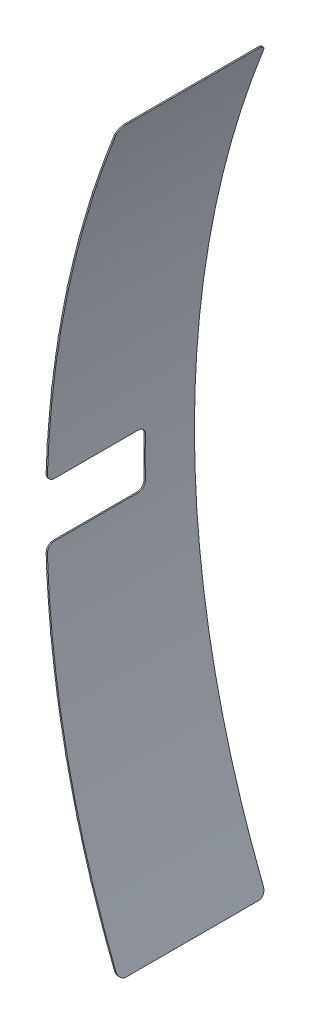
ISO-10303-21;
HEADER;
FILE_DESCRIPTION(('STEP AP214'),'2;1');
FILE_NAME('part.step','',(''),(''),'','','');
FILE_SCHEMA(('AUTOMOTIVE_DESIGN { 1 0 10303 214 1 1 1 1 }'));
ENDSEC;
DATA;
#1=APPLICATION_CONTEXT('core data for automotive mechanical design processes');
#2=APPLICATION_PROTOCOL_DEFINITION('international standard','automotive_design',2000,#1);
#3=PRODUCT_CONTEXT('',#1,'mechanical');
#4=PRODUCT('Part','Part','',(#3));
#5=PRODUCT_RELATED_PRODUCT_CATEGORY('part','',(#4));
#6=PRODUCT_DEFINITION_FORMATION('','',#4);
#7=PRODUCT_DEFINITION_CONTEXT('part definition',#1,'design');
#8=PRODUCT_DEFINITION('design','',#6,#7);
#9=PRODUCT_DEFINITION_SHAPE('','',#8);
#10=(LENGTH_UNIT() NAMED_UNIT(*) SI_UNIT(.MILLI.,.METRE.));
#11=(NAMED_UNIT(*) PLANE_ANGLE_UNIT() SI_UNIT($,.RADIAN.));
#12=(NAMED_UNIT(*) SI_UNIT($,.STERADIAN.) SOLID_ANGLE_UNIT());
#13=UNCERTAINTY_MEASURE_WITH_UNIT(LENGTH_MEASURE(1.E-05),#10,'distance_accuracy_value','');
#14=(GEOMETRIC_REPRESENTATION_CONTEXT(3) GLOBAL_UNCERTAINTY_ASSIGNED_CONTEXT((#13)) GLOBAL_UNIT_ASSIGNED_CONTEXT((#10,
#11,#12)) REPRESENTATION_CONTEXT('',''));
#15=CARTESIAN_POINT('',(0.,0.,0.));
#16=DIRECTION('',(0.,0.,1.));
#17=DIRECTION('',(1.,0.,0.));
#18=AXIS2_PLACEMENT_3D('',#15,#16,#17);
#19=CARTESIAN_POINT('',(0.,0.,6.));
#20=DIRECTION('',(0.,0.,-1.));
#21=DIRECTION('',(-1.,0.,0.));
#22=AXIS2_PLACEMENT_3D('',#19,#20,#21);
#23=CYLINDRICAL_SURFACE('',#22,40.05);
#24=CARTESIAN_POINT('',(0.,0.,6.));
#25=DIRECTION('',(0.,0.,1.));
#26=DIRECTION('',(1.,0.,0.));
#27=AXIS2_PLACEMENT_3D('',#24,#25,#26);
#28=CIRCLE('',#27,40.05);
#29=CARTESIAN_POINT('',(-39.9789767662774,2.38409662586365,6.));
#30=VERTEX_POINT('',#29);
#31=CARTESIAN_POINT('',(-40.0255231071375,1.4,6.));
#32=VERTEX_POINT('',#31);
#33=EDGE_CURVE('E1098',#30,#32,#28,.T.);
#34=ORIENTED_EDGE('',*,*,#33,.F.);
#35=DIRECTION('',(0.,0.,-1.));
#36=VECTOR('',#35,1.);
#37=CARTESIAN_POINT('',(-39.9789767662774,2.38409662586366,6.));
#38=LINE('',#37,#36);
#39=CARTESIAN_POINT('',(-39.9789767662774,2.38409662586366,2.));
#40=VERTEX_POINT('',#39);
#41=EDGE_CURVE('E961',#30,#40,#38,.T.);
#42=ORIENTED_EDGE('',*,*,#41,.T.);
#43=CARTESIAN_POINT('',(0.,0.,2.));
#44=DIRECTION('',(0.,0.,-1.));
#45=DIRECTION('',(-0.997916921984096,0.0645121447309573,0.));
#46=AXIS2_PLACEMENT_3D('',#43,#44,#45);
#47=CIRCLE('',#46,40.05);
#48=CARTESIAN_POINT('',(-39.966572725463,2.58371139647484,2.));
#49=VERTEX_POINT('',#48);
#50=EDGE_CURVE('E945',#40,#49,#47,.T.);
#51=ORIENTED_EDGE('',*,*,#50,.T.);
#52=DIRECTION('',(0.,0.,1.));
#53=VECTOR('',#52,1.);
#54=CARTESIAN_POINT('',(-39.966572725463,2.58371139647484,2.));
#55=LINE('',#54,#53);
#56=CARTESIAN_POINT('',(-39.966572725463,2.58371139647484,6.));
#57=VERTEX_POINT('',#56);
#58=EDGE_CURVE('E951',#49,#57,#55,.T.);
#59=ORIENTED_EDGE('',*,*,#58,.T.);
#60=CARTESIAN_POINT('',(-39.8101315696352,4.37674815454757,6.));
#61=VERTEX_POINT('',#60);
#62=EDGE_CURVE('E977',#61,#57,#28,.T.);
#63=ORIENTED_EDGE('',*,*,#62,.F.);
#64=DIRECTION('',(0.,0.,-1.));
#65=VECTOR('',#64,1.);
#66=CARTESIAN_POINT('',(-39.8101315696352,4.37674815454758,5.99999999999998));
#67=LINE('',#66,#65);
#68=CARTESIAN_POINT('',(-39.8101315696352,4.37674815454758,1.99999999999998));
#69=VERTEX_POINT('',#68);
#70=EDGE_CURVE('E957',#61,#69,#67,.T.);
#71=ORIENTED_EDGE('',*,*,#70,.T.);
#72=CARTESIAN_POINT('',(0.,0.,1.99999999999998));
#73=DIRECTION('',(0.,0.,-1.));
#74=DIRECTION('',(-0.993452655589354,0.114244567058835,0.));
#75=AXIS2_PLACEMENT_3D('',#72,#73,#74);
#76=CIRCLE('',#75,40.05);
#77=CARTESIAN_POINT('',(-39.7877788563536,4.57549491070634,1.99999999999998));
#78=VERTEX_POINT('',#77);
#79=EDGE_CURVE('E1004',#69,#78,#76,.T.);
#80=ORIENTED_EDGE('',*,*,#79,.T.);
#81=DIRECTION('',(0.,0.,1.));
#82=VECTOR('',#81,1.);
#83=CARTESIAN_POINT('',(-39.7877788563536,4.57549491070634,1.99999999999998));
#84=LINE('',#83,#82);
#85=CARTESIAN_POINT('',(-39.7877788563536,4.57549491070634,6.));
#86=VERTEX_POINT('',#85);
#87=EDGE_CURVE('E999',#78,#86,#84,.T.);
#88=ORIENTED_EDGE('',*,*,#87,.T.);
#89=CARTESIAN_POINT('',(-39.5420300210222,6.35848738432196,6.));
#90=VERTEX_POINT('',#89);
#91=EDGE_CURVE('E988',#90,#86,#28,.T.);
#92=ORIENTED_EDGE('',*,*,#91,.F.);
#93=DIRECTION('',(0.,0.,-1.));
#94=VECTOR('',#93,1.);
#95=CARTESIAN_POINT('',(-39.5420300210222,6.35848738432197,5.99999999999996));
#96=LINE('',#95,#94);
#97=CARTESIAN_POINT('',(-39.5420300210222,6.35848738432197,1.99999999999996));
#98=VERTEX_POINT('',#97);
#99=EDGE_CURVE('E1003',#90,#98,#96,.T.);
#100=ORIENTED_EDGE('',*,*,#99,.T.);
#101=CARTESIAN_POINT('',(0.,0.,1.99999999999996));
#102=DIRECTION('',(0.,0.,-1.));
#103=DIRECTION('',(-0.986511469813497,0.163692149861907,0.));
#104=AXIS2_PLACEMENT_3D('',#101,#102,#103);
#105=CIRCLE('',#104,40.05);
#106=CARTESIAN_POINT('',(-39.5097843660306,6.55587060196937,1.99999999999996));
#107=VERTEX_POINT('',#106);
#108=EDGE_CURVE('E1041',#98,#107,#105,.T.);
#109=ORIENTED_EDGE('',*,*,#108,.T.);
#110=DIRECTION('',(0.,0.,1.));
#111=VECTOR('',#110,1.);
#112=CARTESIAN_POINT('',(-39.5097843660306,6.55587060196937,1.99999999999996));
#113=LINE('',#112,#111);
#114=CARTESIAN_POINT('',(-39.5097843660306,6.55587060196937,6.));
#115=VERTEX_POINT('',#114);
#116=EDGE_CURVE('E1037',#107,#115,#113,.T.);
#117=ORIENTED_EDGE('',*,*,#116,.T.);
#118=CARTESIAN_POINT('',(-39.1753405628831,8.3243733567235,6.));
#119=VERTEX_POINT('',#118);
#120=EDGE_CURVE('E1026',#119,#115,#28,.T.);
#121=ORIENTED_EDGE('',*,*,#120,.F.);
#122=DIRECTION('',(0.,0.,-1.));
#123=VECTOR('',#122,1.);
#124=CARTESIAN_POINT('',(-39.1753405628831,8.32437335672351,5.99999999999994));
#125=LINE('',#124,#123);
#126=CARTESIAN_POINT('',(-39.1753405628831,8.32437335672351,1.99999999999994));
#127=VERTEX_POINT('',#126);
#128=EDGE_CURVE('E530',#119,#127,#125,.T.);
#129=ORIENTED_EDGE('',*,*,#128,.T.);
#130=CARTESIAN_POINT('',(0.,0.,1.99999999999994));
#131=DIRECTION('',(0.,0.,-1.));
#132=DIRECTION('',(-0.977110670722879,0.212731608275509,0.));
#133=AXIS2_PLACEMENT_3D('',#130,#131,#132);
#134=CIRCLE('',#133,40.05);
#135=CARTESIAN_POINT('',(-39.1332823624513,8.51990091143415,1.99999999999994));
#136=VERTEX_POINT('',#135);
#137=EDGE_CURVE('E1076',#127,#136,#134,.T.);
#138=ORIENTED_EDGE('',*,*,#137,.T.);
#139=DIRECTION('',(0.,0.,1.));
#140=VECTOR('',#139,1.);
#141=CARTESIAN_POINT('',(-39.1332823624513,8.51990091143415,1.99999999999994));
#142=LINE('',#141,#140);
#143=CARTESIAN_POINT('',(-39.1332823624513,8.51990091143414,6.));
#144=VERTEX_POINT('',#143);
#145=EDGE_CURVE('E1072',#136,#144,#142,.T.);
#146=ORIENTED_EDGE('',*,*,#145,.T.);
#147=CARTESIAN_POINT('',(-38.7109774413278,10.2695046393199,6.));
#148=VERTEX_POINT('',#147);
#149=EDGE_CURVE('E1062',#148,#144,#28,.T.);
#150=ORIENTED_EDGE('',*,*,#149,.F.);
#151=DIRECTION('',(0.,0.,-1.));
#152=VECTOR('',#151,1.);
#153=CARTESIAN_POINT('',(-38.7109774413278,10.2695046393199,5.99999999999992));
#154=LINE('',#153,#152);
#155=CARTESIAN_POINT('',(-38.7109774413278,10.2695046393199,1.99999999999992));
#156=VERTEX_POINT('',#155);
#157=EDGE_CURVE('E1075',#148,#156,#154,.T.);
#158=ORIENTED_EDGE('',*,*,#157,.T.);
#159=CARTESIAN_POINT('',(0.,0.,1.99999999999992));
#160=DIRECTION('',(0.,0.,-1.));
#161=DIRECTION('',(-0.965273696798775,0.261240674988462,0.));
#162=AXIS2_PLACEMENT_3D('',#159,#160,#161);
#163=CIRCLE('',#162,40.05);
#164=CARTESIAN_POINT('',(-38.6592115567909,10.4626890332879,1.99999999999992));
#165=VERTEX_POINT('',#164);
#166=EDGE_CURVE('E1655',#156,#165,#163,.T.);
#167=ORIENTED_EDGE('',*,*,#166,.T.);
#168=DIRECTION('',(0.,0.,1.));
#169=VECTOR('',#168,1.);
#170=CARTESIAN_POINT('',(-38.6592115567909,10.4626890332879,1.99999999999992));
#171=LINE('',#170,#169);
#172=CARTESIAN_POINT('',(-38.6592115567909,10.4626890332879,6.));
#173=VERTEX_POINT('',#172);
#174=EDGE_CURVE('E1232',#165,#173,#171,.T.);
#175=ORIENTED_EDGE('',*,*,#174,.T.);
#176=CARTESIAN_POINT('',(-38.1500984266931,12.1890315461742,6.));
#177=VERTEX_POINT('',#176);
#178=EDGE_CURVE('E1094',#177,#173,#28,.T.);
#179=ORIENTED_EDGE('',*,*,#178,.F.);
#180=DIRECTION('',(0.,0.,-1.));
#181=VECTOR('',#180,1.);
#182=CARTESIAN_POINT('',(-38.1500984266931,12.1890315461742,5.9999999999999));
#183=LINE('',#182,#181);
#184=CARTESIAN_POINT('',(-38.1500984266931,12.1890315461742,1.9999999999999));
#185=VERTEX_POINT('',#184);
#186=EDGE_CURVE('E1229',#177,#185,#183,.T.);
#187=ORIENTED_EDGE('',*,*,#186,.T.);
#188=CARTESIAN_POINT('',(0.,0.,1.9999999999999));
#189=DIRECTION('',(0.,0.,-1.));
#190=DIRECTION('',(-0.951030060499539,0.309098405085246,0.));
#191=AXIS2_PLACEMENT_3D('',#188,#189,#190);
#192=CIRCLE('',#191,40.05);
#193=CARTESIAN_POINT('',(-38.0887539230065,12.3793911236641,1.9999999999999));
#194=VERTEX_POINT('',#193);
#195=EDGE_CURVE('E1225',#185,#194,#192,.T.);
#196=ORIENTED_EDGE('',*,*,#195,.T.);
#197=DIRECTION('',(0.,0.,1.));
#198=VECTOR('',#197,1.);
#199=CARTESIAN_POINT('',(-38.0887539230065,12.3793911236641,1.9999999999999));
#200=LINE('',#199,#198);
#201=CARTESIAN_POINT('',(-38.0887539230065,12.3793911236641,6.));
#202=VERTEX_POINT('',#201);
#203=EDGE_CURVE('E1220',#194,#202,#200,.T.);
#204=ORIENTED_EDGE('',*,*,#203,.T.);
#205=CARTESIAN_POINT('',(-37.2546976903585,14.7,6.));
#206=VERTEX_POINT('',#205);
#207=EDGE_CURVE('E1112',#206,#202,#28,.T.);
#208=ORIENTED_EDGE('',*,*,#207,.F.);
#209=CARTESIAN_POINT('',(-37.2546976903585,14.7,6.));
#210=CARTESIAN_POINT('',(-37.2476427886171,14.7178809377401,6.00000913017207));
#211=CARTESIAN_POINT('',(-37.2405729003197,14.7357592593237,5.99840165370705));
#212=CARTESIAN_POINT('',(-37.2265941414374,14.7710371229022,5.99201729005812));
#213=CARTESIAN_POINT('',(-37.2196855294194,14.7884359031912,5.98723563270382));
#214=CARTESIAN_POINT('',(-37.2062349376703,14.8222439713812,5.97455969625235));
#215=CARTESIAN_POINT('',(-37.1996933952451,14.8386520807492,5.96666179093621));
#216=CARTESIAN_POINT('',(-37.1872048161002,14.8699220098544,5.94790796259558));
#217=CARTESIAN_POINT('',(-37.181257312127,14.8847850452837,5.93705438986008));
#218=CARTESIAN_POINT('',(-37.1703791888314,14.9119286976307,5.91307744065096));
#219=CARTESIAN_POINT('',(-37.1654191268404,14.9242844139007,5.90005269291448));
#220=CARTESIAN_POINT('',(-37.1564510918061,14.9465978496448,5.87179390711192));
#221=CARTESIAN_POINT('',(-37.1524430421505,14.9565557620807,5.85656004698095));
#222=CARTESIAN_POINT('',(-37.1458144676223,14.9730104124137,5.82550614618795));
#223=CARTESIAN_POINT('',(-37.14311472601,14.9797049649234,5.8098076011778));
#224=CARTESIAN_POINT('',(-37.1388200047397,14.9903496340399,5.77737615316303));
#225=CARTESIAN_POINT('',(-37.1372230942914,14.9943045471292,5.76064511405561));
#226=CARTESIAN_POINT('',(-37.1357845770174,14.9978666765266,5.73645797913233));
#227=CARTESIAN_POINT('',(-37.1354615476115,14.9986664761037,5.72918772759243));
#228=CARTESIAN_POINT('',(-37.1350309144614,14.9997326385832,5.71461295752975));
#229=CARTESIAN_POINT('',(-37.134922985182,14.9999998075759,5.70730850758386));
#230=CARTESIAN_POINT('',(-37.1349229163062,15.,5.7));
#231=B_SPLINE_CURVE_WITH_KNOTS('',3,(#209,#210,#211,#212,#213,#214,#215,#216,#217,#218,#219,
#220,#221,#222,#223,#224,#225,#226,#227,#228,#229,#230),.UNSPECIFIED.,.F.,.F.,(4,2,2,2,2,2,2,2,
2,2,4),(0.,0.0576060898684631,0.115298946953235,0.173059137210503,0.230773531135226,
0.286356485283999,0.341934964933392,0.393505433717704,0.444985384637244,0.466930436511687,
0.488842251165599),.UNSPECIFIED.);
#232=CARTESIAN_POINT('',(-37.1349229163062,15.,5.7));
#233=VERTEX_POINT('',#232);
#234=EDGE_CURVE('E1224',#206,#233,#231,.T.);
#235=ORIENTED_EDGE('',*,*,#234,.T.);
#236=DIRECTION('',(0.,0.,-1.));
#237=VECTOR('',#236,1.);
#238=CARTESIAN_POINT('',(-37.1349229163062,15.,6.));
#239=LINE('',#238,#237);
#240=CARTESIAN_POINT('',(-37.1349229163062,15.,0.3));
#241=VERTEX_POINT('',#240);
#242=EDGE_CURVE('E1973',#233,#241,#239,.T.);
#243=ORIENTED_EDGE('',*,*,#242,.T.);
#244=CARTESIAN_POINT('',(-37.1349229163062,15.,0.3));
#245=CARTESIAN_POINT('',(-37.1349154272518,15.0000178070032,0.283999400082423));
#246=CARTESIAN_POINT('',(-37.1354394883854,14.9987211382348,0.268010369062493));
#247=CARTESIAN_POINT('',(-37.1374920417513,14.9936385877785,0.236543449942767));
#248=CARTESIAN_POINT('',(-37.1390177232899,14.9898596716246,0.221064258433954));
#249=CARTESIAN_POINT('',(-37.1430149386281,14.9799521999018,0.191014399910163));
#250=CARTESIAN_POINT('',(-37.145486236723,14.9738242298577,0.176443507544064));
#251=CARTESIAN_POINT('',(-37.151277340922,14.9594502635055,0.148568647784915));
#252=CARTESIAN_POINT('',(-37.1545974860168,14.9512034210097,0.135265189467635));
#253=CARTESIAN_POINT('',(-37.16208301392,14.9325881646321,0.109846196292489));
#254=CARTESIAN_POINT('',(-37.1662710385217,14.9221628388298,0.0977791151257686));
#255=CARTESIAN_POINT('',(-37.1752880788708,14.8996846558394,0.0755539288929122));
#256=CARTESIAN_POINT('',(-37.1801172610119,14.8876313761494,0.0653963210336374));
#257=CARTESIAN_POINT('',(-37.1906279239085,14.8613561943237,0.0465372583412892));
#258=CARTESIAN_POINT('',(-37.196345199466,14.847042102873,0.0379843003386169));
#259=CARTESIAN_POINT('',(-37.2081891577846,14.8173349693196,0.0234019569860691));
#260=CARTESIAN_POINT('',(-37.214315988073,14.8019415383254,0.0173734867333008));
#261=CARTESIAN_POINT('',(-37.2261342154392,14.7721920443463,0.00844822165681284));
#262=CARTESIAN_POINT('',(-37.2318002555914,14.7579058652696,0.00528164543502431));
#263=CARTESIAN_POINT('',(-37.2432130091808,14.7290810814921,0.00105744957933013));
#264=CARTESIAN_POINT('',(-37.2489595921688,14.7145428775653,-3.25508560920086E-06));
#265=CARTESIAN_POINT('',(-37.2546976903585,14.7,0.));
#266=B_SPLINE_CURVE_WITH_KNOTS('',3,(#244,#245,#246,#247,#248,#249,#250,#251,#252,#253,#254,
#255,#256,#257,#258,#259,#260,#261,#262,#263,#264,#265),.UNSPECIFIED.,.F.,.F.,(4,2,2,2,2,2,2,2,
2,2,4),(0.,0.0479228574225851,0.0957118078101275,0.143488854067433,0.191285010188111,
0.240535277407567,0.28979835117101,0.34245474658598,0.395130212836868,0.442062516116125,
0.488926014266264),.UNSPECIFIED.);
#267=CARTESIAN_POINT('',(-37.2546976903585,14.7,0.));
#268=VERTEX_POINT('',#267);
#269=EDGE_CURVE('E1823',#241,#268,#266,.T.);
#270=ORIENTED_EDGE('',*,*,#269,.T.);
#271=CARTESIAN_POINT('',(0.,0.,0.));
#272=DIRECTION('',(0.,0.,1.));
#273=DIRECTION('',(1.,0.,0.));
#274=AXIS2_PLACEMENT_3D('',#271,#272,#273);
#275=CIRCLE('',#274,40.05);
#276=CARTESIAN_POINT('',(-39.9267561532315,3.13952911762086,0.));
#277=VERTEX_POINT('',#276);
#278=EDGE_CURVE('E1569',#268,#277,#275,.T.);
#279=ORIENTED_EDGE('',*,*,#278,.T.);
#280=CARTESIAN_POINT('',(-40.0497455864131,0.142753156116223,2.));
#281=CARTESIAN_POINT('',(-40.0461812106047,1.14274746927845,1.33333288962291));
#282=CARTESIAN_POINT('',(-40.0051464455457,2.14260570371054,0.666667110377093));
#283=CARTESIAN_POINT('',(-39.9267561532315,3.13952911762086,0.));
#284=B_SPLINE_CURVE_WITH_KNOTS('',3,(#280,#281,#282,#283),.UNSPECIFIED.,.F.,.F.,(4,4),(0.,1.),.UNSPECIFIED.);
#285=CARTESIAN_POINT('',(-40.0497455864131,0.142753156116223,2.));
#286=VERTEX_POINT('',#285);
#287=EDGE_CURVE('E1578',#277,#286,#284,.F.);
#288=ORIENTED_EDGE('',*,*,#287,.T.);
#289=CARTESIAN_POINT('',(0.,0.,2.));
#290=DIRECTION('',(0.,0.,-1.));
#291=DIRECTION('',(-1.,0.,0.));
#292=AXIS2_PLACEMENT_3D('',#289,#290,#291);
#293=CIRCLE('',#292,40.05);
#294=CARTESIAN_POINT('',(-40.0420091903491,0.8,2.));
#295=VERTEX_POINT('',#294);
#296=EDGE_CURVE('E1587',#286,#295,#293,.T.);
#297=ORIENTED_EDGE('',*,*,#296,.T.);
#298=CARTESIAN_POINT('',(-40.0420091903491,0.8,2.));
#299=CARTESIAN_POINT('',(-40.0416723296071,0.816881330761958,1.99998568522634));
#300=CARTESIAN_POINT('',(-40.0413240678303,0.833758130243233,2.00142403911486));
#301=CARTESIAN_POINT('',(-40.0406174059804,0.867021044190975,2.00710021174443));
#302=CARTESIAN_POINT('',(-40.0402590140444,0.883407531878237,2.01133584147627));
#303=CARTESIAN_POINT('',(-40.0395440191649,0.915243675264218,2.02250367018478));
#304=CARTESIAN_POINT('',(-40.0391874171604,0.930692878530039,2.02943715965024));
#305=CARTESIAN_POINT('',(-40.0384905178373,0.960205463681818,2.04579798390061));
#306=CARTESIAN_POINT('',(-40.0381502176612,0.974269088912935,2.05522487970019));
#307=CARTESIAN_POINT('',(-40.0375004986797,1.00061378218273,2.07630651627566));
#308=CARTESIAN_POINT('',(-40.0371910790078,1.01289490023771,2.08796119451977));
#309=CARTESIAN_POINT('',(-40.0366172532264,1.03532851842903,2.1131706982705));
#310=CARTESIAN_POINT('',(-40.0363528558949,1.04548060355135,2.12672589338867));
#311=CARTESIAN_POINT('',(-40.0358818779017,1.06336380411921,2.15534743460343));
#312=CARTESIAN_POINT('',(-40.0356752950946,1.07109500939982,2.17041372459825));
#313=CARTESIAN_POINT('',(-40.0353302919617,1.08391410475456,2.20162820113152));
#314=CARTESIAN_POINT('',(-40.0351918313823,1.08900355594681,2.21777574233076));
#315=CARTESIAN_POINT('',(-40.0350247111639,1.09512658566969,2.24501883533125));
#316=CARTESIAN_POINT('',(-40.0349746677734,1.09695300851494,2.25594264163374));
#317=CARTESIAN_POINT('',(-40.0349078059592,1.09938955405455,2.27790943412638));
#318=CARTESIAN_POINT('',(-40.03489094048,1.10000139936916,2.2889522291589));
#319=CARTESIAN_POINT('',(-40.0348910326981,1.10000000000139,2.29999999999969));
#320=B_SPLINE_CURVE_WITH_KNOTS('',3,(#298,#299,#300,#301,#302,#303,#304,#305,#306,#307,#308,
#309,#310,#311,#312,#313,#314,#315,#316,#317,#318,#319),.UNSPECIFIED.,.F.,.F.,(4,2,2,2,2,2,2,2,
2,2,4),(0.,0.0505867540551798,0.101133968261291,0.1517053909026,0.202267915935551,
0.252829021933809,0.30339997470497,0.353969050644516,0.404508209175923,0.437671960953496,
0.470788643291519),.UNSPECIFIED.);
#321=CARTESIAN_POINT('',(-40.034891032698,1.1,2.3));
#322=VERTEX_POINT('',#321);
#323=EDGE_CURVE('E2590',#295,#322,#320,.T.);
#324=ORIENTED_EDGE('',*,*,#323,.T.);
#325=DIRECTION('',(0.,0.,-1.));
#326=VECTOR('',#325,1.);
#327=CARTESIAN_POINT('',(-40.034891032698,1.1,6.));
#328=LINE('',#327,#326);
#329=CARTESIAN_POINT('',(-40.034891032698,1.1,5.7));
#330=VERTEX_POINT('',#329);
#331=EDGE_CURVE('E1131',#322,#330,#328,.F.);
#332=ORIENTED_EDGE('',*,*,#331,.T.);
#333=CARTESIAN_POINT('',(-40.034891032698,1.1,5.7));
#334=CARTESIAN_POINT('',(-40.0348911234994,1.09998564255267,5.71687248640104));
#335=CARTESIAN_POINT('',(-40.0348519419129,1.10142254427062,5.73374066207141));
#336=CARTESIAN_POINT('',(-40.0346957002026,1.10709288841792,5.76698674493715));
#337=CARTESIAN_POINT('',(-40.0345787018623,1.11132411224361,5.78336503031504));
#338=CARTESIAN_POINT('',(-40.0342674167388,1.12248009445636,5.81518552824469));
#339=CARTESIAN_POINT('',(-40.0340730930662,1.12940613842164,5.83062728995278));
#340=CARTESIAN_POINT('',(-40.0336087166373,1.1457487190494,5.8601261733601));
#341=CARTESIAN_POINT('',(-40.0333386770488,1.15516482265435,5.87418353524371));
#342=CARTESIAN_POINT('',(-40.0327254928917,1.17622281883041,5.90051962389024));
#343=CARTESIAN_POINT('',(-40.032382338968,1.18786499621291,5.9127981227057));
#344=CARTESIAN_POINT('',(-40.0316272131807,1.21304617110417,5.9352287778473));
#345=CARTESIAN_POINT('',(-40.0312152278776,1.22658553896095,5.94538051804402));
#346=CARTESIAN_POINT('',(-40.0303288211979,1.25518086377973,5.96327199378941));
#347=CARTESIAN_POINT('',(-40.0298543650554,1.27023766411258,5.97101037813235));
#348=CARTESIAN_POINT('',(-40.0288523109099,1.30143209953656,5.98384573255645));
#349=CARTESIAN_POINT('',(-40.0283247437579,1.31756910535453,5.98894422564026));
#350=CARTESIAN_POINT('',(-40.0274160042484,1.34483667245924,5.99509400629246));
#351=CARTESIAN_POINT('',(-40.0270463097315,1.35579653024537,5.99693267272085));
#352=CARTESIAN_POINT('',(-40.0262937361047,1.37783612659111,5.99938551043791));
#353=CARTESIAN_POINT('',(-40.0259108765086,1.38891567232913,6.00000142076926));
#354=CARTESIAN_POINT('',(-40.0255231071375,1.39999999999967,6.00000000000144));
#355=B_SPLINE_CURVE_WITH_KNOTS('',3,(#333,#334,#335,#336,#337,#338,#339,#340,#341,#342,#343,
#344,#345,#346,#347,#348,#349,#350,#351,#352,#353,#354),.UNSPECIFIED.,.F.,.F.,(4,2,2,2,2,2,2,2,
2,2,4),(0.,0.0505501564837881,0.101060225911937,0.151594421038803,0.202119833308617,
0.25265171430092,0.303193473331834,0.35376347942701,0.404304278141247,0.437598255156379,
0.470844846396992),.UNSPECIFIED.);
#356=EDGE_CURVE('E1123',#330,#32,#355,.T.);
#357=ORIENTED_EDGE('',*,*,#356,.T.);
#358=EDGE_LOOP('',(#34,#42,#51,#59,#63,#71,#80,#88,#92,#100,#109,#117,#121,#129,#138,#146,#150,
#158,#167,#175,#179,#187,#196,#204,#208,#235,#243,#270,#279,#288,#297,#324,#332,#357));
#359=FACE_BOUND('',#358,.T.);
#360=ADVANCED_FACE('F526',(#359),#23,.T.);
#361=CARTESIAN_POINT('',(0.,0.,6.));
#362=DIRECTION('',(0.,0.,1.));
#363=DIRECTION('',(1.,0.,0.));
#364=AXIS2_PLACEMENT_3D('',#361,#362,#363);
#365=PLANE('',#364);
#366=ORIENTED_EDGE('',*,*,#207,.T.);
#367=DIRECTION('',(0.951030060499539,-0.309098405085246,0.));
#368=VECTOR('',#367,1.);
#369=CARTESIAN_POINT('',(-38.0887539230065,12.3793911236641,6.));
#370=LINE('',#369,#368);
#371=CARTESIAN_POINT('',(-38.0982642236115,12.3824821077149,6.));
#372=VERTEX_POINT('',#371);
#373=EDGE_CURVE('E1201',#372,#202,#370,.T.);
#374=ORIENTED_EDGE('',*,*,#373,.F.);
#375=CARTESIAN_POINT('',(0.,0.,6.));
#376=DIRECTION('',(0.,0.,-1.));
#377=DIRECTION('',(-1.,0.,0.));
#378=AXIS2_PLACEMENT_3D('',#375,#376,#377);
#379=CIRCLE('',#378,40.06);
#380=CARTESIAN_POINT('',(-38.1596240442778,12.1920749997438,6.));
#381=VERTEX_POINT('',#380);
#382=EDGE_CURVE('E1122',#372,#381,#379,.F.);
#383=ORIENTED_EDGE('',*,*,#382,.T.);
#384=DIRECTION('',(0.952561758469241,-0.304345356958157,0.));
#385=VECTOR('',#384,1.);
#386=CARTESIAN_POINT('',(-38.1500984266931,12.1890315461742,6.));
#387=LINE('',#386,#385);
#388=EDGE_CURVE('E1129',#381,#177,#387,.T.);
#389=ORIENTED_EDGE('',*,*,#388,.T.);
#390=ORIENTED_EDGE('',*,*,#178,.T.);
#391=DIRECTION('',(0.965273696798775,-0.261240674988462,0.));
#392=VECTOR('',#391,1.);
#393=CARTESIAN_POINT('',(-38.6592115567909,10.4626890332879,6.));
#394=LINE('',#393,#392);
#395=CARTESIAN_POINT('',(-38.6688642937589,10.4653014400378,6.));
#396=VERTEX_POINT('',#395);
#397=EDGE_CURVE('E1065',#396,#173,#394,.T.);
#398=ORIENTED_EDGE('',*,*,#397,.F.);
#399=CARTESIAN_POINT('',(0.,0.,6.));
#400=DIRECTION('',(0.,0.,-1.));
#401=DIRECTION('',(-1.,0.,0.));
#402=AXIS2_PLACEMENT_3D('',#399,#400,#401);
#403=CIRCLE('',#402,40.06);
#404=CARTESIAN_POINT('',(-38.7206431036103,10.272068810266,6.));
#405=VERTEX_POINT('',#404);
#406=EDGE_CURVE('E1192',#396,#405,#403,.F.);
#407=ORIENTED_EDGE('',*,*,#406,.T.);
#408=DIRECTION('',(0.966566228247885,-0.256417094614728,0.));
#409=VECTOR('',#408,1.);
#410=CARTESIAN_POINT('',(-38.7109774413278,10.2695046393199,6.));
#411=LINE('',#410,#409);
#412=EDGE_CURVE('E1093',#405,#148,#411,.T.);
#413=ORIENTED_EDGE('',*,*,#412,.T.);
#414=ORIENTED_EDGE('',*,*,#149,.T.);
#415=DIRECTION('',(0.977110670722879,-0.212731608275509,0.));
#416=VECTOR('',#415,1.);
#417=CARTESIAN_POINT('',(-39.1332823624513,8.51990091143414,6.));
#418=LINE('',#417,#416);
#419=CARTESIAN_POINT('',(-39.1430534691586,8.5220282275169,6.));
#420=VERTEX_POINT('',#419);
#421=EDGE_CURVE('E1030',#420,#144,#418,.T.);
#422=ORIENTED_EDGE('',*,*,#421,.F.);
#423=CARTESIAN_POINT('',(0.,0.,6.));
#424=DIRECTION('',(0.,0.,-1.));
#425=DIRECTION('',(-1.,0.,0.));
#426=AXIS2_PLACEMENT_3D('',#423,#424,#425);
#427=CIRCLE('',#426,40.06);
#428=CARTESIAN_POINT('',(-39.1851221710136,8.32645185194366,6.));
#429=VERTEX_POINT('',#428);
#430=EDGE_CURVE('E1053',#420,#429,#427,.F.);
#431=ORIENTED_EDGE('',*,*,#430,.T.);
#432=DIRECTION('',(0.978160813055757,-0.207849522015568,0.));
#433=VECTOR('',#432,1.);
#434=CARTESIAN_POINT('',(-39.1753405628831,8.3243733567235,6.));
#435=LINE('',#434,#433);
#436=EDGE_CURVE('E1051',#429,#119,#435,.T.);
#437=ORIENTED_EDGE('',*,*,#436,.T.);
#438=ORIENTED_EDGE('',*,*,#120,.T.);
#439=DIRECTION('',(0.986511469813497,-0.163692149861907,0.));
#440=VECTOR('',#439,1.);
#441=CARTESIAN_POINT('',(-39.5097843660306,6.55587060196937,6.));
#442=LINE('',#441,#440);
#443=CARTESIAN_POINT('',(-39.5196494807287,6.55750752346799,6.));
#444=VERTEX_POINT('',#443);
#445=EDGE_CURVE('E992',#444,#115,#442,.T.);
#446=ORIENTED_EDGE('',*,*,#445,.F.);
#447=CARTESIAN_POINT('',(0.,0.,6.));
#448=DIRECTION('',(0.,0.,-1.));
#449=DIRECTION('',(-1.,0.,0.));
#450=AXIS2_PLACEMENT_3D('',#447,#448,#449);
#451=CIRCLE('',#450,40.06);
#452=CARTESIAN_POINT('',(-39.5519031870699,6.36007502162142,6.));
#453=VERTEX_POINT('',#452);
#454=EDGE_CURVE('E1016',#444,#453,#451,.F.);
#455=ORIENTED_EDGE('',*,*,#454,.T.);
#456=DIRECTION('',(0.987316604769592,-0.158763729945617,0.));
#457=VECTOR('',#456,1.);
#458=CARTESIAN_POINT('',(-39.5420300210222,6.35848738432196,6.));
#459=LINE('',#458,#457);
#460=EDGE_CURVE('E1013',#453,#90,#459,.T.);
#461=ORIENTED_EDGE('',*,*,#460,.T.);
#462=ORIENTED_EDGE('',*,*,#91,.T.);
#463=DIRECTION('',(0.993452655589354,-0.114244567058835,0.));
#464=VECTOR('',#463,1.);
#465=CARTESIAN_POINT('',(-39.7877788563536,4.57549491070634,6.));
#466=LINE('',#465,#464);
#467=CARTESIAN_POINT('',(-39.7977133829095,4.57663735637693,6.));
#468=VERTEX_POINT('',#467);
#469=EDGE_CURVE('E970',#468,#86,#466,.T.);
#470=ORIENTED_EDGE('',*,*,#469,.F.);
#471=CARTESIAN_POINT('',(0.,0.,6.));
#472=DIRECTION('',(0.,0.,-1.));
#473=DIRECTION('',(-1.,0.,0.));
#474=AXIS2_PLACEMENT_3D('',#471,#472,#473);
#475=CIRCLE('',#474,40.06);
#476=CARTESIAN_POINT('',(-39.8200716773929,4.37784097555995,6.));
#477=VERTEX_POINT('',#476);
#478=EDGE_CURVE('E978',#468,#477,#475,.F.);
#479=ORIENTED_EDGE('',*,*,#478,.T.);
#480=DIRECTION('',(0.994010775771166,-0.109282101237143,0.));
#481=VECTOR('',#480,1.);
#482=CARTESIAN_POINT('',(-39.8101315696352,4.37674815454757,6.));
#483=LINE('',#482,#481);
#484=EDGE_CURVE('E974',#477,#61,#483,.T.);
#485=ORIENTED_EDGE('',*,*,#484,.T.);
#486=ORIENTED_EDGE('',*,*,#62,.T.);
#487=DIRECTION('',(0.997916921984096,-0.0645121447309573,0.));
#488=VECTOR('',#487,1.);
#489=CARTESIAN_POINT('',(-39.966572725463,2.58371139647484,6.));
#490=LINE('',#489,#488);
#491=CARTESIAN_POINT('',(-39.9765518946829,2.58435651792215,6.));
#492=VERTEX_POINT('',#491);
#493=EDGE_CURVE('E13',#492,#57,#490,.T.);
#494=ORIENTED_EDGE('',*,*,#493,.F.);
#495=CARTESIAN_POINT('',(0.,0.,6.));
#496=DIRECTION('',(0.,0.,-1.));
#497=DIRECTION('',(-1.,0.,0.));
#498=AXIS2_PLACEMENT_3D('',#495,#496,#497);
#499=CIRCLE('',#498,40.06);
#500=CARTESIAN_POINT('',(-39.988959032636,2.38469190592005,6.));
#501=VERTEX_POINT('',#500);
#502=EDGE_CURVE('E1097',#492,#501,#499,.F.);
#503=ORIENTED_EDGE('',*,*,#502,.T.);
#504=DIRECTION('',(0.998226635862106,-0.0595280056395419,0.));
#505=VECTOR('',#504,1.);
#506=CARTESIAN_POINT('',(-39.9789767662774,2.38409662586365,6.));
#507=LINE('',#506,#505);
#508=EDGE_CURVE('E1101',#501,#30,#507,.T.);
#509=ORIENTED_EDGE('',*,*,#508,.T.);
#510=ORIENTED_EDGE('',*,*,#33,.T.);
#511=DIRECTION('',(-1.,0.,0.));
#512=VECTOR('',#511,1.);
#513=CARTESIAN_POINT('',(-39.9848721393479,1.4,6.));
#514=LINE('',#513,#512);
#515=CARTESIAN_POINT('',(-39.9754924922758,1.4,6.));
#516=VERTEX_POINT('',#515);
#517=EDGE_CURVE('E1103',#32,#516,#514,.F.);
#518=ORIENTED_EDGE('',*,*,#517,.T.);
#519=CARTESIAN_POINT('',(0.,0.,6.));
#520=DIRECTION('',(0.,0.,-1.));
#521=DIRECTION('',(1.,0.,0.));
#522=AXIS2_PLACEMENT_3D('',#519,#520,#521);
#523=CIRCLE('',#522,40.);
#524=CARTESIAN_POINT('',(-37.2009408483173,14.7,6.));
#525=VERTEX_POINT('',#524);
#526=EDGE_CURVE('E1106',#516,#525,#523,.T.);
#527=ORIENTED_EDGE('',*,*,#526,.T.);
#528=DIRECTION('',(-1.,0.,0.));
#529=VECTOR('',#528,1.);
#530=CARTESIAN_POINT('',(-37.1349229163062,14.7,6.));
#531=LINE('',#530,#529);
#532=EDGE_CURVE('E1454',#525,#206,#531,.T.);
#533=ORIENTED_EDGE('',*,*,#532,.T.);
#534=EDGE_LOOP('',(#366,#374,#383,#389,#390,#398,#407,#413,#414,#422,#431,#437,#438,#446,#455,
#461,#462,#470,#479,#485,#486,#494,#503,#509,#510,#518,#527,#533));
#535=FACE_BOUND('',#534,.T.);
#536=ADVANCED_FACE('F1432',(#535),#365,.T.);
#537=CARTESIAN_POINT('',(0.,0.,6.));
#538=DIRECTION('',(0.,0.,-1.));
#539=DIRECTION('',(-1.,0.,0.));
#540=AXIS2_PLACEMENT_3D('',#537,#538,#539);
#541=CYLINDRICAL_SURFACE('',#540,40.);
#542=ORIENTED_EDGE('',*,*,#526,.F.);
#543=CARTESIAN_POINT('',(-39.9754924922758,1.4,6.));
#544=CARTESIAN_POINT('',(-39.9760841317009,1.38311816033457,6.00001431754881));
#545=CARTESIAN_POINT('',(-39.9766641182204,1.36624008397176,5.99857586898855));
#546=CARTESIAN_POINT('',(-39.9777869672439,1.33297306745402,5.99289857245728));
#547=CARTESIAN_POINT('',(-39.9783298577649,1.31658376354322,5.98866186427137));
#548=CARTESIAN_POINT('',(-39.9793658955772,1.28474086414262,5.97749014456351));
#549=CARTESIAN_POINT('',(-39.9798590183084,1.26928773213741,5.9705538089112));
#550=CARTESIAN_POINT('',(-39.9807853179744,1.2397673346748,5.95418521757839));
#551=CARTESIAN_POINT('',(-39.9812185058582,1.22569981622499,5.94475341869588));
#552=CARTESIAN_POINT('',(-39.9820175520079,1.19935258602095,5.92366338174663));
#553=CARTESIAN_POINT('',(-39.9823834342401,1.18707223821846,5.91200593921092));
#554=CARTESIAN_POINT('',(-39.9830431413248,1.16464045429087,5.88679036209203));
#555=CARTESIAN_POINT('',(-39.9833369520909,1.15448943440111,5.87323185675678));
#556=CARTESIAN_POINT('',(-39.9838491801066,1.13661119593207,5.84460683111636));
#557=CARTESIAN_POINT('',(-39.9840676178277,1.12888331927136,5.82954072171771));
#558=CARTESIAN_POINT('',(-39.9844273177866,1.11607051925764,5.79832713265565));
#559=CARTESIAN_POINT('',(-39.9845686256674,1.11098403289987,5.78218029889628));
#560=CARTESIAN_POINT('',(-39.9847380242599,1.10486694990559,5.75494498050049));
#561=CARTESIAN_POINT('',(-39.9847883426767,1.10304294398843,5.74402823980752));
#562=CARTESIAN_POINT('',(-39.9848553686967,1.10060963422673,5.72207586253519));
#563=CARTESIAN_POINT('',(-39.9848721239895,1.09999860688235,5.71104041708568));
#564=CARTESIAN_POINT('',(-39.9848721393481,1.0999999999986,5.70000000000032));
#565=B_SPLINE_CURVE_WITH_KNOTS('',3,(#543,#544,#545,#546,#547,#548,#549,#550,#551,#552,#553,
#554,#555,#556,#557,#558,#559,#560,#561,#562,#563,#564),.UNSPECIFIED.,.F.,.F.,(4,2,2,2,2,2,2,2,
2,2,4),(0.,0.050609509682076,0.101180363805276,0.151776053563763,0.202362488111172,
0.252930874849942,0.30350913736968,0.354073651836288,0.404608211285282,0.437749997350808,
0.470844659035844),.UNSPECIFIED.);
#566=CARTESIAN_POINT('',(-39.9848721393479,1.1,5.7));
#567=VERTEX_POINT('',#566);
#568=EDGE_CURVE('E1443',#516,#567,#565,.T.);
#569=ORIENTED_EDGE('',*,*,#568,.T.);
#570=DIRECTION('',(0.,0.,-1.));
#571=VECTOR('',#570,1.);
#572=CARTESIAN_POINT('',(-39.9848721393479,1.1,6.));
#573=LINE('',#572,#571);
#574=CARTESIAN_POINT('',(-39.9848721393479,1.1,2.3));
#575=VERTEX_POINT('',#574);
#576=EDGE_CURVE('E1480',#567,#575,#573,.T.);
#577=ORIENTED_EDGE('',*,*,#576,.T.);
#578=CARTESIAN_POINT('',(-39.9848721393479,1.1,2.3));
#579=CARTESIAN_POINT('',(-39.9848714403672,1.10001435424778,2.28312676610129));
#580=CARTESIAN_POINT('',(-39.9849112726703,1.09857732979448,2.2662578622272));
#581=CARTESIAN_POINT('',(-39.9850668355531,1.09290650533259,2.23301043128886));
#582=CARTESIAN_POINT('',(-39.9851825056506,1.08867493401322,2.21663152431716));
#583=CARTESIAN_POINT('',(-39.9854846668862,1.07751803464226,2.18480986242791));
#584=CARTESIAN_POINT('',(-39.9856711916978,1.07059142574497,2.16936755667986));
#585=CARTESIAN_POINT('',(-39.9861054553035,1.05424737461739,2.13986753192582));
#586=CARTESIAN_POINT('',(-39.9863531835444,1.04483036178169,2.12580957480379));
#587=CARTESIAN_POINT('',(-39.986897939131,1.0237693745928,2.09947148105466));
#588=CARTESIAN_POINT('',(-39.9871949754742,1.01212499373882,2.08719166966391));
#589=CARTESIAN_POINT('',(-39.9878245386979,0.98693821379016,2.06475860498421));
#590=CARTESIAN_POINT('',(-39.9881570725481,0.973395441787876,2.05460577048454));
#591=CARTESIAN_POINT('',(-39.988843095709,0.944792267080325,2.03671301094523));
#592=CARTESIAN_POINT('',(-39.9891965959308,0.929731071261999,2.02897435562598));
#593=CARTESIAN_POINT('',(-39.9899098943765,0.898526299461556,2.01613955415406));
#594=CARTESIAN_POINT('',(-39.9902696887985,0.882383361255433,2.01104186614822));
#595=CARTESIAN_POINT('',(-39.9908600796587,0.855118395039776,2.00489796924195));
#596=CARTESIAN_POINT('',(-39.9910927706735,0.844167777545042,2.00306236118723));
#597=CARTESIAN_POINT('',(-39.991551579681,0.822146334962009,2.00061353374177));
#598=CARTESIAN_POINT('',(-39.9917777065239,0.811075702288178,1.9999985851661));
#599=CARTESIAN_POINT('',(-39.99199919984,0.800000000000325,1.99999999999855));
#600=B_SPLINE_CURVE_WITH_KNOTS('',3,(#578,#579,#580,#581,#582,#583,#584,#585,#586,#587,#588,
#589,#590,#591,#592,#593,#594,#595,#596,#597,#598,#599),.UNSPECIFIED.,.F.,.F.,(4,2,2,2,2,2,2,2,
2,2,4),(0.,0.050552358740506,0.101064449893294,0.151600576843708,0.202127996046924,
0.252664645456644,0.30321123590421,0.353784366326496,0.404327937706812,0.43758208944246,
0.470789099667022),.UNSPECIFIED.);
#601=CARTESIAN_POINT('',(-39.99199919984,0.8,2.));
#602=VERTEX_POINT('',#601);
#603=EDGE_CURVE('E2593',#575,#602,#600,.T.);
#604=ORIENTED_EDGE('',*,*,#603,.T.);
#605=CARTESIAN_POINT('',(0.,0.,2.));
#606=DIRECTION('',(0.,0.,-1.));
#607=DIRECTION('',(-1.,0.,0.));
#608=AXIS2_PLACEMENT_3D('',#605,#606,#607);
#609=CIRCLE('',#608,40.);
#610=CARTESIAN_POINT('',(-39.99199919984,-0.8,2.));
#611=VERTEX_POINT('',#610);
#612=EDGE_CURVE('E1541',#602,#611,#609,.F.);
#613=ORIENTED_EDGE('',*,*,#612,.T.);
#614=CARTESIAN_POINT('',(-39.99199919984,-0.8,2.));
#615=CARTESIAN_POINT('',(-39.9916619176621,-0.816881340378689,1.99998568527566));
#616=CARTESIAN_POINT('',(-39.9913132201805,-0.833758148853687,2.00142404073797));
#617=CARTESIAN_POINT('',(-39.9906056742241,-0.867021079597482,2.0071002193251));
#618=CARTESIAN_POINT('',(-39.9902468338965,-0.883407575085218,2.01133585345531));
#619=CARTESIAN_POINT('',(-39.9895309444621,-0.915243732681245,2.02250369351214));
#620=CARTESIAN_POINT('',(-39.9891738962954,-0.93069294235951,2.02943718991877));
#621=CARTESIAN_POINT('',(-39.9884761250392,-0.960205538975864,2.04579803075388));
#622=CARTESIAN_POINT('',(-39.9881353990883,-0.974269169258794,2.05522493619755));
#623=CARTESIAN_POINT('',(-39.9874848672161,-1.00061387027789,2.07630659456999));
#624=CARTESIAN_POINT('',(-39.9871750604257,-1.01289499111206,2.08796128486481));
#625=CARTESIAN_POINT('',(-39.9866005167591,-1.03532861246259,2.11317081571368));
#626=CARTESIAN_POINT('',(-39.9863357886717,-1.04548069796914,2.12672602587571));
#627=CARTESIAN_POINT('',(-39.9858642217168,-1.06336389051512,2.15534759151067));
#628=CARTESIAN_POINT('',(-39.9856573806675,-1.0710950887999,2.1704138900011));
#629=CARTESIAN_POINT('',(-39.9853119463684,-1.08391416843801,2.20162838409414));
#630=CARTESIAN_POINT('',(-39.9851733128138,-1.08900361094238,2.21777593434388));
#631=CARTESIAN_POINT('',(-39.9850059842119,-1.09512661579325,2.24501900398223));
#632=CARTESIAN_POINT('',(-39.9849558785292,-1.09695302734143,2.25594277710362));
#633=CARTESIAN_POINT('',(-39.9848889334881,-1.09938955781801,2.27790950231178));
#634=CARTESIAN_POINT('',(-39.9848720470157,-1.10000139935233,2.28895226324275));
#635=CARTESIAN_POINT('',(-39.9848721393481,-1.10000000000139,2.29999999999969));
#636=B_SPLINE_CURVE_WITH_KNOTS('',3,(#614,#615,#616,#617,#618,#619,#620,#621,#622,#623,#624,
#625,#626,#627,#628,#629,#630,#631,#632,#633,#634,#635),.UNSPECIFIED.,.F.,.F.,(4,2,2,2,2,2,2,2,
2,2,4),(0.,0.0505868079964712,0.101134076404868,0.15170555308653,0.202268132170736,
0.252829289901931,0.3034002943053,0.353969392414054,0.404508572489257,0.437672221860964,
0.470788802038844),.UNSPECIFIED.);
#637=CARTESIAN_POINT('',(-39.9848721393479,-1.1,2.3));
#638=VERTEX_POINT('',#637);
#639=EDGE_CURVE('E1533',#611,#638,#636,.T.);
#640=ORIENTED_EDGE('',*,*,#639,.T.);
#641=DIRECTION('',(0.,0.,-1.));
#642=VECTOR('',#641,1.);
#643=CARTESIAN_POINT('',(-39.9848721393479,-1.1,6.));
#644=LINE('',#643,#642);
#645=CARTESIAN_POINT('',(-39.9848721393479,-1.1,5.7));
#646=VERTEX_POINT('',#645);
#647=EDGE_CURVE('E1540',#638,#646,#644,.F.);
#648=ORIENTED_EDGE('',*,*,#647,.T.);
#649=CARTESIAN_POINT('',(-39.9848721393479,-1.1,5.7));
#650=CARTESIAN_POINT('',(-39.984872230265,-1.09998564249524,5.71687247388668));
#651=CARTESIAN_POINT('',(-39.9848329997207,-1.10142254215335,5.73374063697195));
#652=CARTESIAN_POINT('',(-39.9846765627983,-1.1070928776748,5.76698669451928));
#653=CARTESIAN_POINT('',(-39.9845594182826,-1.11132409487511,5.78336496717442));
#654=CARTESIAN_POINT('',(-39.9842477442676,-1.12248005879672,5.81518544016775));
#655=CARTESIAN_POINT('',(-39.9840531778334,-1.12940609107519,5.83062718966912));
#656=CARTESIAN_POINT('',(-39.9835882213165,-1.14574864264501,5.86012605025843));
#657=CARTESIAN_POINT('',(-39.9833178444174,-1.15516472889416,5.87418340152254));
#658=CARTESIAN_POINT('',(-39.9827038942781,-1.17622268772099,5.90051947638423));
#659=CARTESIAN_POINT('',(-39.9823603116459,-1.18786484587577,5.91279797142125));
#660=CARTESIAN_POINT('',(-39.9816042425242,-1.2130459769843,5.9352286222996));
#661=CARTESIAN_POINT('',(-39.9811917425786,-1.22658532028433,5.94538036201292));
#662=CARTESIAN_POINT('',(-39.9803042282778,-1.2551806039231,5.96327185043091));
#663=CARTESIAN_POINT('',(-39.9798291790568,-1.27023738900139,5.97101024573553));
#664=CARTESIAN_POINT('',(-39.9788258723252,-1.30143179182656,5.98384562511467));
#665=CARTESIAN_POINT('',(-39.9782976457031,-1.3175687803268,5.98894413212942));
#666=CARTESIAN_POINT('',(-39.977387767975,-1.34483638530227,5.99509395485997));
#667=CARTESIAN_POINT('',(-39.9770176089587,-1.35579630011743,5.99693264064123));
#668=CARTESIAN_POINT('',(-39.976264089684,-1.37783601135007,5.99938550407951));
#669=CARTESIAN_POINT('',(-39.9758807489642,-1.38891561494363,6.00000142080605));
#670=CARTESIAN_POINT('',(-39.9754924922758,-1.39999999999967,6.00000000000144));
#671=B_SPLINE_CURVE_WITH_KNOTS('',3,(#649,#650,#651,#652,#653,#654,#655,#656,#657,#658,#659,
#660,#661,#662,#663,#664,#665,#666,#667,#668,#669,#670),.UNSPECIFIED.,.F.,.F.,(4,2,2,2,2,2,2,2,
2,2,4),(0.,0.0505501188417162,0.10106014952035,0.151594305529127,0.202119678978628,
0.25265153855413,0.303193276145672,0.353763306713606,0.404304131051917,0.437598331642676,
0.470845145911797),.UNSPECIFIED.);
#672=CARTESIAN_POINT('',(-39.9754924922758,-1.4,6.));
#673=VERTEX_POINT('',#672);
#674=EDGE_CURVE('E1481',#646,#673,#671,.T.);
#675=ORIENTED_EDGE('',*,*,#674,.T.);
#676=CARTESIAN_POINT('',(-37.2009408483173,-14.7,6.));
#677=VERTEX_POINT('',#676);
#678=EDGE_CURVE('E1119',#677,#673,#523,.T.);
#679=ORIENTED_EDGE('',*,*,#678,.F.);
#680=CARTESIAN_POINT('',(-37.2009408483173,-14.7,6.));
#681=CARTESIAN_POINT('',(-37.1938745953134,-14.7178838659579,6.00000911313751));
#682=CARTESIAN_POINT('',(-37.1867933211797,-14.7357651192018,5.99840112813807));
#683=CARTESIAN_POINT('',(-37.1727919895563,-14.7710488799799,5.99201462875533));
#684=CARTESIAN_POINT('',(-37.1658721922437,-14.7884506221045,5.98723132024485));
#685=CARTESIAN_POINT('',(-37.152399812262,-14.8222644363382,5.97455081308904));
#686=CARTESIAN_POINT('',(-37.145847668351,-14.838675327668,5.96664998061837));
#687=CARTESIAN_POINT('',(-37.1333389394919,-14.8699503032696,5.94788886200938));
#688=CARTESIAN_POINT('',(-37.1273818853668,-14.884815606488,5.93703093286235));
#689=CARTESIAN_POINT('',(-37.1164871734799,-14.9119611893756,5.91304532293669));
#690=CARTESIAN_POINT('',(-37.1115199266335,-14.9243168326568,5.90001662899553));
#691=CARTESIAN_POINT('',(-37.1025392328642,-14.946629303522,5.87174907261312));
#692=CARTESIAN_POINT('',(-37.0985257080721,-14.9565863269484,5.85651039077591));
#693=CARTESIAN_POINT('',(-37.0918893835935,-14.9730362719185,5.8254498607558));
#694=CARTESIAN_POINT('',(-37.0891870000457,-14.9797276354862,5.80974988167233));
#695=CARTESIAN_POINT('',(-37.0848886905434,-14.9903657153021,5.77731581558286));
#696=CARTESIAN_POINT('',(-37.0832908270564,-14.994317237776,5.76058359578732));
#697=CARTESIAN_POINT('',(-37.0818528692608,-14.9978728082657,5.73640573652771));
#698=CARTESIAN_POINT('',(-37.0815302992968,-14.998670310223,5.72914583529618));
#699=CARTESIAN_POINT('',(-37.0811002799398,-14.9997334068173,5.71459192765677));
#700=CARTESIAN_POINT('',(-37.0809925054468,-14.9999998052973,5.70729798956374));
#701=CARTESIAN_POINT('',(-37.0809924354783,-15.,5.7));
#702=B_SPLINE_CURVE_WITH_KNOTS('',3,(#680,#681,#682,#683,#684,#685,#686,#687,#688,#689,#690,
#691,#692,#693,#694,#695,#696,#697,#698,#699,#700,#701),.UNSPECIFIED.,.F.,.F.,(4,2,2,2,2,2,2,2,
2,2,4),(0.,0.0576267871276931,0.115340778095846,0.173122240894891,0.230857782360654,
0.286454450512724,0.342046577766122,0.393618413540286,0.445099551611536,0.46701303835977,
0.488893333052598),.UNSPECIFIED.);
#703=CARTESIAN_POINT('',(-37.0809924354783,-15.,5.7));
#704=VERTEX_POINT('',#703);
#705=EDGE_CURVE('E1525',#677,#704,#702,.T.);
#706=ORIENTED_EDGE('',*,*,#705,.T.);
#707=DIRECTION('',(0.,0.,-1.));
#708=VECTOR('',#707,1.);
#709=CARTESIAN_POINT('',(-37.0809924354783,-15.,6.));
#710=LINE('',#709,#708);
#711=CARTESIAN_POINT('',(-37.0809924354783,-15.,0.3));
#712=VERTEX_POINT('',#711);
#713=EDGE_CURVE('E1727',#704,#712,#710,.T.);
#714=ORIENTED_EDGE('',*,*,#713,.T.);
#715=CARTESIAN_POINT('',(-37.0809924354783,-15.,0.3));
#716=CARTESIAN_POINT('',(-37.080984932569,-15.0000178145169,0.284001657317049));
#717=CARTESIAN_POINT('',(-37.0815096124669,-14.9987215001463,0.268014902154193));
#718=CARTESIAN_POINT('',(-37.0835645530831,-14.9936404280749,0.236552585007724));
#719=CARTESIAN_POINT('',(-37.0850919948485,-14.9898626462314,0.221075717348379));
#720=CARTESIAN_POINT('',(-37.0890937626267,-14.97995829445,0.19103044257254));
#721=CARTESIAN_POINT('',(-37.0915678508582,-14.9738323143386,0.176461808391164));
#722=CARTESIAN_POINT('',(-37.0973654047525,-14.9594632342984,0.148591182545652));
#723=CARTESIAN_POINT('',(-37.1006892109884,-14.9512192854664,0.135289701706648));
#724=CARTESIAN_POINT('',(-37.1081831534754,-14.9326101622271,0.10987330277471));
#725=CARTESIAN_POINT('',(-37.1123760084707,-14.9221879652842,0.0978069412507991));
#726=CARTESIAN_POINT('',(-37.1214033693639,-14.8997167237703,0.0755826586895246));
#727=CARTESIAN_POINT('',(-37.1262380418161,-14.8876672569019,0.0654252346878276));
#728=CARTESIAN_POINT('',(-37.1367615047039,-14.8613982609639,0.0465640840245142));
#729=CARTESIAN_POINT('',(-37.1424862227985,-14.8470863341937,0.0380091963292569));
#730=CARTESIAN_POINT('',(-37.1543456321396,-14.817383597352,0.0234226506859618));
#731=CARTESIAN_POINT('',(-37.1604804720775,-14.801992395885,0.0173919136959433));
#732=CARTESIAN_POINT('',(-37.1723182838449,-14.77223680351,0.00845883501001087));
#733=CARTESIAN_POINT('',(-37.177996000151,-14.757941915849,0.00528827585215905));
#734=CARTESIAN_POINT('',(-37.1894323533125,-14.7290993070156,0.00105877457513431));
#735=CARTESIAN_POINT('',(-37.1951908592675,-14.7145519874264,-3.25783842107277E-06));
#736=CARTESIAN_POINT('',(-37.2009408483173,-14.7,0.));
#737=B_SPLINE_CURVE_WITH_KNOTS('',3,(#715,#716,#717,#718,#719,#720,#721,#722,#723,#724,#725,
#726,#727,#728,#729,#730,#731,#732,#733,#734,#735,#736),.UNSPECIFIED.,.F.,.F.,(4,2,2,2,2,2,2,2,
2,2,4),(0.,0.0479160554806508,0.0956979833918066,0.143467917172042,0.191257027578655,
0.240503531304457,0.289762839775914,0.342424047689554,0.395104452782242,0.442075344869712,
0.48897734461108),.UNSPECIFIED.);
#738=CARTESIAN_POINT('',(-37.2009408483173,-14.7,0.));
#739=VERTEX_POINT('',#738);
#740=EDGE_CURVE('E1518',#712,#739,#737,.T.);
#741=ORIENTED_EDGE('',*,*,#740,.T.);
#742=CARTESIAN_POINT('',(0.,0.,0.));
#743=DIRECTION('',(0.,0.,-1.));
#744=DIRECTION('',(1.,0.,0.));
#745=AXIS2_PLACEMENT_3D('',#742,#743,#744);
#746=CIRCLE('',#745,40.);
#747=CARTESIAN_POINT('',(-37.2009408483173,14.7,0.));
#748=VERTEX_POINT('',#747);
#749=EDGE_CURVE('E1828',#739,#748,#746,.T.);
#750=ORIENTED_EDGE('',*,*,#749,.T.);
#751=CARTESIAN_POINT('',(-37.2009408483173,14.7,0.));
#752=CARTESIAN_POINT('',(-37.1938745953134,14.7178838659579,-9.11313751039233E-06));
#753=CARTESIAN_POINT('',(-37.1867933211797,14.7357651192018,0.00159887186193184));
#754=CARTESIAN_POINT('',(-37.1727919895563,14.7710488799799,0.00798537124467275));
#755=CARTESIAN_POINT('',(-37.1658721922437,14.7884506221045,0.0127686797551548));
#756=CARTESIAN_POINT('',(-37.152399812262,14.8222644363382,0.0254491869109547));
#757=CARTESIAN_POINT('',(-37.145847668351,14.838675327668,0.0333500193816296));
#758=CARTESIAN_POINT('',(-37.1333389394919,14.8699503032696,0.0521111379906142));
#759=CARTESIAN_POINT('',(-37.1273818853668,14.884815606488,0.0629690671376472));
#760=CARTESIAN_POINT('',(-37.1164871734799,14.9119611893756,0.0869546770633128));
#761=CARTESIAN_POINT('',(-37.1115199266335,14.9243168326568,0.0999833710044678));
#762=CARTESIAN_POINT('',(-37.1025392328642,14.946629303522,0.128250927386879));
#763=CARTESIAN_POINT('',(-37.0985257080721,14.9565863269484,0.143489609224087));
#764=CARTESIAN_POINT('',(-37.0918893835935,14.9730362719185,0.174550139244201));
#765=CARTESIAN_POINT('',(-37.0891870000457,14.9797276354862,0.190250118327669));
#766=CARTESIAN_POINT('',(-37.0848886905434,14.9903657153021,0.222684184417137));
#767=CARTESIAN_POINT('',(-37.0832908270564,14.994317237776,0.239416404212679));
#768=CARTESIAN_POINT('',(-37.0818528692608,14.9978728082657,0.263594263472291));
#769=CARTESIAN_POINT('',(-37.0815302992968,14.998670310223,0.270854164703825));
#770=CARTESIAN_POINT('',(-37.0811002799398,14.9997334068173,0.285408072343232));
#771=CARTESIAN_POINT('',(-37.0809925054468,14.9999998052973,0.292702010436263));
#772=CARTESIAN_POINT('',(-37.0809924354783,15.,0.299999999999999));
#773=B_SPLINE_CURVE_WITH_KNOTS('',3,(#751,#752,#753,#754,#755,#756,#757,#758,#759,#760,#761,
#762,#763,#764,#765,#766,#767,#768,#769,#770,#771,#772),.UNSPECIFIED.,.F.,.F.,(4,2,2,2,2,2,2,2,
2,2,4),(0.,0.0576267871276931,0.115340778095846,0.17312224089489,0.230857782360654,
0.286454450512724,0.342046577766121,0.393618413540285,0.445099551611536,0.467013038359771,
0.488893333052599),.UNSPECIFIED.);
#774=CARTESIAN_POINT('',(-37.0809924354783,15.,0.3));
#775=VERTEX_POINT('',#774);
#776=EDGE_CURVE('E1501',#748,#775,#773,.T.);
#777=ORIENTED_EDGE('',*,*,#776,.T.);
#778=DIRECTION('',(0.,0.,-1.));
#779=VECTOR('',#778,1.);
#780=CARTESIAN_POINT('',(-37.0809924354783,15.,6.));
#781=LINE('',#780,#779);
#782=CARTESIAN_POINT('',(-37.0809924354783,15.,5.7));
#783=VERTEX_POINT('',#782);
#784=EDGE_CURVE('E1549',#783,#775,#781,.T.);
#785=ORIENTED_EDGE('',*,*,#784,.F.);
#786=CARTESIAN_POINT('',(-37.0809924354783,15.,5.7));
#787=CARTESIAN_POINT('',(-37.080984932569,15.0000178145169,5.71599834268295));
#788=CARTESIAN_POINT('',(-37.0815096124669,14.9987215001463,5.73198509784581));
#789=CARTESIAN_POINT('',(-37.0835645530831,14.9936404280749,5.76344741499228));
#790=CARTESIAN_POINT('',(-37.0850919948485,14.9898626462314,5.77892428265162));
#791=CARTESIAN_POINT('',(-37.0890937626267,14.97995829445,5.80896955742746));
#792=CARTESIAN_POINT('',(-37.0915678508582,14.9738323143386,5.82353819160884));
#793=CARTESIAN_POINT('',(-37.0973654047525,14.9594632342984,5.85140881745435));
#794=CARTESIAN_POINT('',(-37.1006892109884,14.9512192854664,5.86471029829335));
#795=CARTESIAN_POINT('',(-37.1081831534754,14.9326101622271,5.89012669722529));
#796=CARTESIAN_POINT('',(-37.1123760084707,14.9221879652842,5.9021930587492));
#797=CARTESIAN_POINT('',(-37.1214033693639,14.8997167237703,5.92441734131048));
#798=CARTESIAN_POINT('',(-37.1262380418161,14.8876672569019,5.93457476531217));
#799=CARTESIAN_POINT('',(-37.1367615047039,14.8613982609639,5.95343591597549));
#800=CARTESIAN_POINT('',(-37.1424862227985,14.8470863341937,5.96199080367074));
#801=CARTESIAN_POINT('',(-37.1543456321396,14.817383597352,5.97657734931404));
#802=CARTESIAN_POINT('',(-37.1604804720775,14.801992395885,5.98260808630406));
#803=CARTESIAN_POINT('',(-37.1723182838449,14.77223680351,5.99154116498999));
#804=CARTESIAN_POINT('',(-37.177996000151,14.757941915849,5.99471172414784));
#805=CARTESIAN_POINT('',(-37.1894323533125,14.7290993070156,5.99894122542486));
#806=CARTESIAN_POINT('',(-37.1951908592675,14.7145519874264,6.00000325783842));
#807=CARTESIAN_POINT('',(-37.2009408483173,14.7,6.));
#808=B_SPLINE_CURVE_WITH_KNOTS('',3,(#786,#787,#788,#789,#790,#791,#792,#793,#794,#795,#796,
#797,#798,#799,#800,#801,#802,#803,#804,#805,#806,#807),.UNSPECIFIED.,.F.,.F.,(4,2,2,2,2,2,2,2,
2,2,4),(0.,0.0479160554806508,0.0956979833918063,0.143467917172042,0.191257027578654,
0.240503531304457,0.289762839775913,0.342424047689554,0.395104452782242,0.44207534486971,
0.48897734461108),.UNSPECIFIED.);
#809=EDGE_CURVE('E1453',#783,#525,#808,.T.);
#810=ORIENTED_EDGE('',*,*,#809,.T.);
#811=EDGE_LOOP('',(#542,#569,#577,#604,#613,#640,#648,#675,#679,#706,#714,#741,#750,#777,#785,#810));
#812=FACE_BOUND('',#811,.T.);
#813=ADVANCED_FACE('F1448',(#812),#541,.F.);
#814=CARTESIAN_POINT('',(-37.1349229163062,15.,6.));
#815=DIRECTION('',(0.,-1.,0.));
#816=DIRECTION('',(0.,0.,-1.));
#817=AXIS2_PLACEMENT_3D('',#814,#815,#816);
#818=PLANE('',#817);
#819=ORIENTED_EDGE('',*,*,#242,.F.);
#820=DIRECTION('',(-1.,0.,0.));
#821=VECTOR('',#820,1.);
#822=CARTESIAN_POINT('',(-37.0809924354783,15.,5.7));
#823=LINE('',#822,#821);
#824=EDGE_CURVE('E1547',#233,#783,#823,.F.);
#825=ORIENTED_EDGE('',*,*,#824,.T.);
#826=ORIENTED_EDGE('',*,*,#784,.T.);
#827=DIRECTION('',(-1.,0.,0.));
#828=VECTOR('',#827,1.);
#829=CARTESIAN_POINT('',(-37.1349229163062,15.,0.3));
#830=LINE('',#829,#828);
#831=EDGE_CURVE('E1261',#775,#241,#830,.T.);
#832=ORIENTED_EDGE('',*,*,#831,.T.);
#833=EDGE_LOOP('',(#819,#825,#826,#832));
#834=FACE_BOUND('',#833,.T.);
#835=ADVANCED_FACE('F1494',(#834),#818,.F.);
#836=CARTESIAN_POINT('',(0.,0.,1.9999999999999));
#837=DIRECTION('',(0.,0.,-1.));
#838=DIRECTION('',(-0.954707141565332,-0.297547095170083,0.));
#839=AXIS2_PLACEMENT_3D('',#836,#837,#838);
#840=CIRCLE('',#839,40.05);
#841=CARTESIAN_POINT('',(-38.1760350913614,-12.1075532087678,1.9999999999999));
#842=VERTEX_POINT('',#841);
#843=CARTESIAN_POINT('',(-38.2360210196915,-11.9167611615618,1.9999999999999));
#844=VERTEX_POINT('',#843);
#845=EDGE_CURVE('E1257',#842,#844,#840,.T.);
#846=ORIENTED_EDGE('',*,*,#845,.T.);
#847=DIRECTION('',(0.,0.,1.));
#848=VECTOR('',#847,1.);
#849=CARTESIAN_POINT('',(-38.2360210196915,-11.9167611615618,1.9999999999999));
#850=LINE('',#849,#848);
#851=CARTESIAN_POINT('',(-38.2360210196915,-11.9167611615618,6.));
#852=VERTEX_POINT('',#851);
#853=EDGE_CURVE('E1252',#844,#852,#850,.T.);
#854=ORIENTED_EDGE('',*,*,#853,.T.);
#855=CARTESIAN_POINT('',(-38.7328146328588,-10.1868331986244,6.));
#856=VERTEX_POINT('',#855);
#857=EDGE_CURVE('E1165',#856,#852,#28,.T.);
#858=ORIENTED_EDGE('',*,*,#857,.F.);
#859=DIRECTION('',(0.,0.,-1.));
#860=VECTOR('',#859,1.);
#861=CARTESIAN_POINT('',(-38.7328146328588,-10.1868331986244,5.99999999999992));
#862=LINE('',#861,#860);
#863=CARTESIAN_POINT('',(-38.7328146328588,-10.1868331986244,1.99999999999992));
#864=VERTEX_POINT('',#863);
#865=EDGE_CURVE('E1256',#856,#864,#862,.T.);
#866=ORIENTED_EDGE('',*,*,#865,.T.);
#867=CARTESIAN_POINT('',(0.,0.,1.99999999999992));
#868=DIRECTION('',(0.,0.,-1.));
#869=DIRECTION('',(-0.968369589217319,-0.249520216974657,0.));
#870=AXIS2_PLACEMENT_3D('',#867,#868,#869);
#871=CIRCLE('',#870,40.05);
#872=CARTESIAN_POINT('',(-38.7832020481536,-9.99328468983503,1.99999999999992));
#873=VERTEX_POINT('',#872);
#874=EDGE_CURVE('E1291',#864,#873,#871,.T.);
#875=ORIENTED_EDGE('',*,*,#874,.T.);
#876=DIRECTION('',(0.,0.,1.));
#877=VECTOR('',#876,1.);
#878=CARTESIAN_POINT('',(-38.7832020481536,-9.99328468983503,1.99999999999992));
#879=LINE('',#878,#877);
#880=CARTESIAN_POINT('',(-38.7832020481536,-9.99328468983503,6.));
#881=VERTEX_POINT('',#880);
#882=EDGE_CURVE('E1286',#873,#881,#879,.T.);
#883=ORIENTED_EDGE('',*,*,#882,.T.);
#884=CARTESIAN_POINT('',(-39.1930238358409,-8.24071493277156,6.));
#885=VERTEX_POINT('',#884);
#886=EDGE_CURVE('E1155',#885,#881,#28,.T.);
#887=ORIENTED_EDGE('',*,*,#886,.F.);
#888=DIRECTION('',(0.,0.,-1.));
#889=VECTOR('',#888,1.);
#890=CARTESIAN_POINT('',(-39.1930238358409,-8.24071493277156,5.99999999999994));
#891=LINE('',#890,#889);
#892=CARTESIAN_POINT('',(-39.1930238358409,-8.24071493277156,1.99999999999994));
#893=VERTEX_POINT('',#892);
#894=EDGE_CURVE('E1290',#885,#893,#891,.T.);
#895=ORIENTED_EDGE('',*,*,#894,.T.);
#896=CARTESIAN_POINT('',(0.,0.,1.99999999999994));
#897=DIRECTION('',(0.,0.,-1.));
#898=DIRECTION('',(-0.979617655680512,-0.200871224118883,0.));
#899=AXIS2_PLACEMENT_3D('',#896,#897,#898);
#900=CIRCLE('',#899,40.05);
#901=CARTESIAN_POINT('',(-39.2336871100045,-8.04489252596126,1.99999999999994));
#902=VERTEX_POINT('',#901);
#903=EDGE_CURVE('E1321',#893,#902,#900,.T.);
#904=ORIENTED_EDGE('',*,*,#903,.T.);
#905=DIRECTION('',(0.,0.,1.));
#906=VECTOR('',#905,1.);
#907=CARTESIAN_POINT('',(-39.2336871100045,-8.04489252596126,1.99999999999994));
#908=LINE('',#907,#906);
#909=CARTESIAN_POINT('',(-39.2336871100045,-8.04489252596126,6.));
#910=VERTEX_POINT('',#909);
#911=EDGE_CURVE('E1316',#902,#910,#908,.T.);
#912=ORIENTED_EDGE('',*,*,#911,.T.);
#913=CARTESIAN_POINT('',(-39.5555152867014,-6.27405055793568,6.));
#914=VERTEX_POINT('',#913);
#915=EDGE_CURVE('E1145',#914,#910,#28,.T.);
#916=ORIENTED_EDGE('',*,*,#915,.F.);
#917=DIRECTION('',(0.,0.,-1.));
#918=VECTOR('',#917,1.);
#919=CARTESIAN_POINT('',(-39.5555152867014,-6.27405055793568,5.99999999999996));
#920=LINE('',#919,#918);
#921=CARTESIAN_POINT('',(-39.5555152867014,-6.27405055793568,1.99999999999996));
#922=VERTEX_POINT('',#921);
#923=EDGE_CURVE('E1320',#914,#922,#920,.T.);
#924=ORIENTED_EDGE('',*,*,#923,.T.);
#925=CARTESIAN_POINT('',(0.,0.,1.99999999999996));
#926=DIRECTION('',(0.,0.,-1.));
#927=DIRECTION('',(-0.988423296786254,-0.151721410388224,0.));
#928=AXIS2_PLACEMENT_3D('',#925,#926,#927);
#929=CIRCLE('',#928,40.05);
#930=CARTESIAN_POINT('',(-39.5863530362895,-6.07644248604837,1.99999999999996));
#931=VERTEX_POINT('',#930);
#932=EDGE_CURVE('E1351',#922,#931,#929,.T.);
#933=ORIENTED_EDGE('',*,*,#932,.T.);
#934=DIRECTION('',(0.,0.,1.));
#935=VECTOR('',#934,1.);
#936=CARTESIAN_POINT('',(-39.5863530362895,-6.07644248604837,1.99999999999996));
#937=LINE('',#936,#935);
#938=CARTESIAN_POINT('',(-39.5863530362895,-6.07644248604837,6.));
#939=VERTEX_POINT('',#938);
#940=EDGE_CURVE('E1346',#931,#939,#937,.T.);
#941=ORIENTED_EDGE('',*,*,#940,.T.);
#942=CARTESIAN_POINT('',(-39.8193852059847,-4.29174344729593,6.));
#943=VERTEX_POINT('',#942);
#944=EDGE_CURVE('E1135',#943,#939,#28,.T.);
#945=ORIENTED_EDGE('',*,*,#944,.F.);
#946=DIRECTION('',(0.,0.,-1.));
#947=VECTOR('',#946,1.);
#948=CARTESIAN_POINT('',(-39.8193852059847,-4.29174344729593,5.99999999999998));
#949=LINE('',#948,#947);
#950=CARTESIAN_POINT('',(-39.8193852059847,-4.29174344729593,1.99999999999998));
#951=VERTEX_POINT('',#950);
#952=EDGE_CURVE('E1350',#943,#951,#949,.T.);
#953=ORIENTED_EDGE('',*,*,#952,.T.);
#954=CARTESIAN_POINT('',(0.,0.,1.99999999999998));
#955=DIRECTION('',(0.,0.,-1.));
#956=DIRECTION('',(-0.994764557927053,-0.102193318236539,0.));
#957=AXIS2_PLACEMENT_3D('',#954,#955,#956);
#958=CIRCLE('',#957,40.05);
#959=CARTESIAN_POINT('',(-39.8403205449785,-4.09284239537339,1.99999999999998));
#960=VERTEX_POINT('',#959);
#961=EDGE_CURVE('E1381',#951,#960,#958,.T.);
#962=ORIENTED_EDGE('',*,*,#961,.T.);
#963=DIRECTION('',(0.,0.,1.));
#964=VECTOR('',#963,1.);
#965=CARTESIAN_POINT('',(-39.8403205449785,-4.09284239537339,1.99999999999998));
#966=LINE('',#965,#964);
#967=CARTESIAN_POINT('',(-39.8403205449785,-4.09284239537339,6.));
#968=VERTEX_POINT('',#967);
#969=EDGE_CURVE('E1376',#960,#968,#966,.T.);
#970=ORIENTED_EDGE('',*,*,#969,.T.);
#971=CARTESIAN_POINT('',(-39.9839757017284,-2.2987359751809,6.));
#972=VERTEX_POINT('',#971);
#973=EDGE_CURVE('E1124',#972,#968,#28,.T.);
#974=ORIENTED_EDGE('',*,*,#973,.F.);
#975=DIRECTION('',(0.,0.,-1.));
#976=VECTOR('',#975,1.);
#977=CARTESIAN_POINT('',(-39.9839757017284,-2.2987359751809,6.));
#978=LINE('',#977,#976);
#979=CARTESIAN_POINT('',(-39.9839757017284,-2.2987359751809,2.));
#980=VERTEX_POINT('',#979);
#981=EDGE_CURVE('E1380',#972,#980,#978,.T.);
#982=ORIENTED_EDGE('',*,*,#981,.T.);
#983=CARTESIAN_POINT('',(0.,0.,2.));
#984=DIRECTION('',(0.,0.,-1.));
#985=DIRECTION('',(-0.998625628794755,-0.0524104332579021,0.));
#986=AXIS2_PLACEMENT_3D('',#983,#984,#985);
#987=CIRCLE('',#986,40.05);
#988=CARTESIAN_POINT('',(-39.9949564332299,-2.09903785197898,2.));
#989=VERTEX_POINT('',#988);
#990=EDGE_CURVE('E1411',#980,#989,#987,.T.);
#991=ORIENTED_EDGE('',*,*,#990,.T.);
#992=DIRECTION('',(0.,0.,1.));
#993=VECTOR('',#992,1.);
#994=CARTESIAN_POINT('',(-39.9949564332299,-2.09903785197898,2.));
#995=LINE('',#994,#993);
#996=CARTESIAN_POINT('',(-39.9949564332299,-2.09903785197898,6.));
#997=VERTEX_POINT('',#996);
#998=EDGE_CURVE('E1406',#989,#997,#995,.T.);
#999=ORIENTED_EDGE('',*,*,#998,.T.);
#1000=CARTESIAN_POINT('',(-40.0255231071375,-1.4,6.));
#1001=VERTEX_POINT('',#1000);
#1002=EDGE_CURVE('E1089',#1001,#997,#28,.T.);
#1003=ORIENTED_EDGE('',*,*,#1002,.F.);
#1004=CARTESIAN_POINT('',(-40.0255231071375,-1.4,6.));
#1005=CARTESIAN_POINT('',(-40.0261140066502,-1.38311817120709,6.00001431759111));
#1006=CARTESIAN_POINT('',(-40.026693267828,-1.36624010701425,5.99857587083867));
#1007=CARTESIAN_POINT('',(-40.0278147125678,-1.33297311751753,5.99289858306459));
#1008=CARTESIAN_POINT('',(-40.0283569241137,-1.31658382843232,5.98866188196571));
#1009=CARTESIAN_POINT('',(-40.0293916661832,-1.28474096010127,5.97749018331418));
#1010=CARTESIAN_POINT('',(-40.0298841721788,-1.2692878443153,5.97055386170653));
#1011=CARTESIAN_POINT('',(-40.0308093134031,-1.23976747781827,5.95418530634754));
#1012=CARTESIAN_POINT('',(-40.0312419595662,-1.22569997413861,5.94475352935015));
#1013=CARTESIAN_POINT('',(-40.0320400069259,-1.19935275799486,5.92366353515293));
#1014=CARTESIAN_POINT('',(-40.0324054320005,-1.18707241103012,5.91200611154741));
#1015=CARTESIAN_POINT('',(-40.033064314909,-1.16464062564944,5.88679057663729));
#1016=CARTESIAN_POINT('',(-40.0333577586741,-1.15448960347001,5.87323209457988));
#1017=CARTESIAN_POINT('',(-40.0338693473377,-1.13661134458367,5.84460710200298));
#1018=CARTESIAN_POINT('',(-40.0340875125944,-1.12888345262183,5.82954100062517));
#1019=CARTESIAN_POINT('',(-40.0344467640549,-1.11607062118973,5.7983274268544));
#1020=CARTESIAN_POINT('',(-40.0345878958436,-1.11098411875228,5.78218060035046));
#1021=CARTESIAN_POINT('',(-40.0347570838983,-1.10486699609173,5.75494523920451));
#1022=CARTESIAN_POINT('',(-40.0348073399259,-1.10304297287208,5.74402844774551));
#1023=CARTESIAN_POINT('',(-40.0348742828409,-1.10060964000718,5.72207596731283));
#1024=CARTESIAN_POINT('',(-40.0348910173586,-1.09999860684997,5.71104046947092));
#1025=CARTESIAN_POINT('',(-40.0348910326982,-1.0999999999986,5.70000000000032));
#1026=B_SPLINE_CURVE_WITH_KNOTS('',3,(#1004,#1005,#1006,#1007,#1008,#1009,#1010,#1011,#1012,
#1013,#1014,#1015,#1016,#1017,#1018,#1019,#1020,#1021,#1022,#1023,#1024,#1025),.UNSPECIFIED.,
.F.,.F.,(4,2,2,2,2,2,2,2,2,2,4),(0.,0.0506093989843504,0.101180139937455,0.15177571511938,
0.202362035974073,0.252930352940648,0.303508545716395,0.354073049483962,0.404607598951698,
0.437749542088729,0.470844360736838),.UNSPECIFIED.);
#1027=CARTESIAN_POINT('',(-40.034891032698,-1.1,5.7));
#1028=VERTEX_POINT('',#1027);
#1029=EDGE_CURVE('E1410',#1001,#1028,#1026,.T.);
#1030=ORIENTED_EDGE('',*,*,#1029,.T.);
#1031=DIRECTION('',(0.,0.,-1.));
#1032=VECTOR('',#1031,1.);
#1033=CARTESIAN_POINT('',(-40.034891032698,-1.1,6.));
#1034=LINE('',#1033,#1032);
#1035=CARTESIAN_POINT('',(-40.034891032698,-1.1,2.3));
#1036=VERTEX_POINT('',#1035);
#1037=EDGE_CURVE('E1732',#1028,#1036,#1034,.T.);
#1038=ORIENTED_EDGE('',*,*,#1037,.T.);
#1039=CARTESIAN_POINT('',(-40.034891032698,-1.1,2.3));
#1040=CARTESIAN_POINT('',(-40.0348903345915,-1.10001435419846,2.28312675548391));
#1041=CARTESIAN_POINT('',(-40.0349301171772,-1.09857732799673,2.26625784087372));
#1042=CARTESIAN_POINT('',(-40.0350854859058,-1.09290649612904,2.23301038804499));
#1043=CARTESIAN_POINT('',(-40.0352010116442,-1.08867491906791,2.21663146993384));
#1044=CARTESIAN_POINT('',(-40.0355027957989,-1.07751800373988,2.18480978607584));
#1045=CARTESIAN_POINT('',(-40.0356890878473,-1.07059138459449,2.1693674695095));
#1046=CARTESIAN_POINT('',(-40.036122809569,-1.05424730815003,2.13986742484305));
#1047=CARTESIAN_POINT('',(-40.0363702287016,-1.04483028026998,2.12580945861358));
#1048=CARTESIAN_POINT('',(-40.0369143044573,-1.02376926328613,2.09947135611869));
#1049=CARTESIAN_POINT('',(-40.037210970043,-1.01212486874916,2.08719154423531));
#1050=CARTESIAN_POINT('',(-40.0378397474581,-0.986938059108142,2.06475848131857));
#1051=CARTESIAN_POINT('',(-40.0381718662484,-0.973395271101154,2.05460564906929));
#1052=CARTESIAN_POINT('',(-40.0388570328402,-0.944792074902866,2.03671290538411));
#1053=CARTESIAN_POINT('',(-40.039210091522,-0.929730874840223,2.02897426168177));
#1054=CARTESIAN_POINT('',(-40.0399224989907,-0.898526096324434,2.01613948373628));
#1055=CARTESIAN_POINT('',(-40.0402818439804,-0.882383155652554,2.0110418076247));
#1056=CARTESIAN_POINT('',(-40.0408714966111,-0.855118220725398,2.00489793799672));
#1057=CARTESIAN_POINT('',(-40.0411038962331,-0.844167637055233,2.00306234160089));
#1058=CARTESIAN_POINT('',(-40.0415621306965,-0.822146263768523,2.00061352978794));
#1059=CARTESIAN_POINT('',(-40.0417879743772,-0.81107566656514,1.99999858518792));
#1060=CARTESIAN_POINT('',(-40.0420091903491,-0.800000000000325,1.99999999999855));
#1061=B_SPLINE_CURVE_WITH_KNOTS('',3,(#1039,#1040,#1041,#1042,#1043,#1044,#1045,#1046,#1047,
#1048,#1049,#1050,#1051,#1052,#1053,#1054,#1055,#1056,#1057,#1058,#1059,#1060),.UNSPECIFIED.,
.F.,.F.,(4,2,2,2,2,2,2,2,2,2,4),(0.,0.0505523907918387,0.101064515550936,0.151600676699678,
0.202128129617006,0.252664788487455,0.30321138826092,0.353784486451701,0.404328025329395,
0.43758205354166,0.470788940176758),.UNSPECIFIED.);
#1062=CARTESIAN_POINT('',(-40.0420091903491,-0.8,2.));
#1063=VERTEX_POINT('',#1062);
#1064=EDGE_CURVE('E1542',#1036,#1063,#1061,.T.);
#1065=ORIENTED_EDGE('',*,*,#1064,.T.);
#1066=EDGE_CURVE('E1818',#1063,#286,#293,.T.);
#1067=ORIENTED_EDGE('',*,*,#1066,.T.);
#1068=CARTESIAN_POINT('',(-39.9481223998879,-2.85482341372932,0.));
#1069=CARTESIAN_POINT('',(-40.0194039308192,-1.85736651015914,0.666667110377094));
#1070=CARTESIAN_POINT('',(-40.0533099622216,-0.857241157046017,1.33333288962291));
#1071=CARTESIAN_POINT('',(-40.0497455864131,0.142753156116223,2.));
#1072=B_SPLINE_CURVE_WITH_KNOTS('',3,(#1068,#1069,#1070,#1071),.UNSPECIFIED.,.F.,.F.,(4,4),(0.,
1.),.UNSPECIFIED.);
#1073=CARTESIAN_POINT('',(-39.9481223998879,-2.85482341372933,0.));
#1074=VERTEX_POINT('',#1073);
#1075=EDGE_CURVE('E1792',#286,#1074,#1072,.F.);
#1076=ORIENTED_EDGE('',*,*,#1075,.T.);
#1077=CARTESIAN_POINT('',(-37.2546976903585,-14.7,0.));
#1078=VERTEX_POINT('',#1077);
#1079=EDGE_CURVE('E1824',#1074,#1078,#275,.T.);
#1080=ORIENTED_EDGE('',*,*,#1079,.T.);
#1081=CARTESIAN_POINT('',(-37.2546976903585,-14.7,0.));
#1082=CARTESIAN_POINT('',(-37.2476427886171,-14.7178809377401,-9.1301720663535E-06));
#1083=CARTESIAN_POINT('',(-37.2405729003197,-14.7357592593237,0.00159834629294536));
#1084=CARTESIAN_POINT('',(-37.2265941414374,-14.7710371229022,0.00798270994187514));
#1085=CARTESIAN_POINT('',(-37.2196855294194,-14.7884359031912,0.0127643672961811));
#1086=CARTESIAN_POINT('',(-37.2062349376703,-14.8222439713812,0.0254403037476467));
#1087=CARTESIAN_POINT('',(-37.1996933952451,-14.8386520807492,0.0333382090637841));
#1088=CARTESIAN_POINT('',(-37.1872048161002,-14.8699220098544,0.0520920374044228));
#1089=CARTESIAN_POINT('',(-37.181257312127,-14.8847850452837,0.0629456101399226));
#1090=CARTESIAN_POINT('',(-37.1703791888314,-14.9119286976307,0.0869225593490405));
#1091=CARTESIAN_POINT('',(-37.1654191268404,-14.9242844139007,0.0999473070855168));
#1092=CARTESIAN_POINT('',(-37.1564510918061,-14.9465978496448,0.128206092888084));
#1093=CARTESIAN_POINT('',(-37.1524430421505,-14.9565557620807,0.143439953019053));
#1094=CARTESIAN_POINT('',(-37.1458144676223,-14.9730104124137,0.174493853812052));
#1095=CARTESIAN_POINT('',(-37.14311472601,-14.9797049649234,0.190192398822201));
#1096=CARTESIAN_POINT('',(-37.1388200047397,-14.9903496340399,0.222623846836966));
#1097=CARTESIAN_POINT('',(-37.1372230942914,-14.9943045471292,0.239354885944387));
#1098=CARTESIAN_POINT('',(-37.1357845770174,-14.9978666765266,0.263542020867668));
#1099=CARTESIAN_POINT('',(-37.1354615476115,-14.9986664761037,0.270812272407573));
#1100=CARTESIAN_POINT('',(-37.1350309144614,-14.9997326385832,0.285387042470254));
#1101=CARTESIAN_POINT('',(-37.134922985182,-14.9999998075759,0.292691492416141));
#1102=CARTESIAN_POINT('',(-37.1349229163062,-15.,0.299999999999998));
#1103=B_SPLINE_CURVE_WITH_KNOTS('',3,(#1081,#1082,#1083,#1084,#1085,#1086,#1087,#1088,#1089,
#1090,#1091,#1092,#1093,#1094,#1095,#1096,#1097,#1098,#1099,#1100,#1101,#1102),.UNSPECIFIED.,
.F.,.F.,(4,2,2,2,2,2,2,2,2,2,4),(0.,0.0576060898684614,0.115298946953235,0.173059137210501,
0.230773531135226,0.286356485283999,0.341934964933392,0.393505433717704,0.444985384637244,
0.466930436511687,0.488842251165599),.UNSPECIFIED.);
#1104=CARTESIAN_POINT('',(-37.1349229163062,-15.,0.3));
#1105=VERTEX_POINT('',#1104);
#1106=EDGE_CURVE('E1719',#1078,#1105,#1103,.T.);
#1107=ORIENTED_EDGE('',*,*,#1106,.T.);
#1108=DIRECTION('',(0.,0.,-1.));
#1109=VECTOR('',#1108,1.);
#1110=CARTESIAN_POINT('',(-37.1349229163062,-15.,6.));
#1111=LINE('',#1110,#1109);
#1112=CARTESIAN_POINT('',(-37.1349229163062,-15.,5.7));
#1113=VERTEX_POINT('',#1112);
#1114=EDGE_CURVE('E1462',#1113,#1105,#1111,.T.);
#1115=ORIENTED_EDGE('',*,*,#1114,.F.);
#1116=CARTESIAN_POINT('',(-37.1349229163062,-15.,5.7));
#1117=CARTESIAN_POINT('',(-37.1349154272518,-15.0000178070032,5.71600059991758));
#1118=CARTESIAN_POINT('',(-37.1354394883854,-14.9987211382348,5.73198963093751));
#1119=CARTESIAN_POINT('',(-37.1374920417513,-14.9936385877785,5.76345655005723));
#1120=CARTESIAN_POINT('',(-37.1390177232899,-14.9898596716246,5.77893574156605));
#1121=CARTESIAN_POINT('',(-37.1430149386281,-14.9799521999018,5.80898560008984));
#1122=CARTESIAN_POINT('',(-37.145486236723,-14.9738242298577,5.82355649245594));
#1123=CARTESIAN_POINT('',(-37.151277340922,-14.9594502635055,5.85143135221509));
#1124=CARTESIAN_POINT('',(-37.1545974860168,-14.9512034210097,5.86473481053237));
#1125=CARTESIAN_POINT('',(-37.16208301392,-14.9325881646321,5.89015380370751));
#1126=CARTESIAN_POINT('',(-37.1662710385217,-14.9221628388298,5.90222088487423));
#1127=CARTESIAN_POINT('',(-37.1752880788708,-14.8996846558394,5.92444607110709));
#1128=CARTESIAN_POINT('',(-37.1801172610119,-14.8876313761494,5.93460367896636));
#1129=CARTESIAN_POINT('',(-37.1906279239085,-14.8613561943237,5.95346274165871));
#1130=CARTESIAN_POINT('',(-37.196345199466,-14.847042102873,5.96201569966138));
#1131=CARTESIAN_POINT('',(-37.2081891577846,-14.8173349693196,5.97659804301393));
#1132=CARTESIAN_POINT('',(-37.214315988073,-14.8019415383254,5.9826265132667));
#1133=CARTESIAN_POINT('',(-37.2261342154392,-14.7721920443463,5.99155177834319));
#1134=CARTESIAN_POINT('',(-37.2318002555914,-14.7579058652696,5.99471835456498));
#1135=CARTESIAN_POINT('',(-37.2432130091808,-14.7290810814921,5.99894255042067));
#1136=CARTESIAN_POINT('',(-37.2489595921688,-14.7145428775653,6.00000325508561));
#1137=CARTESIAN_POINT('',(-37.2546976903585,-14.7,6.));
#1138=B_SPLINE_CURVE_WITH_KNOTS('',3,(#1116,#1117,#1118,#1119,#1120,#1121,#1122,#1123,#1124,
#1125,#1126,#1127,#1128,#1129,#1130,#1131,#1132,#1133,#1134,#1135,#1136,#1137),.UNSPECIFIED.,
.F.,.F.,(4,2,2,2,2,2,2,2,2,2,4),(0.,0.047922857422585,0.0957118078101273,0.143488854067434,
0.191285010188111,0.240535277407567,0.28979835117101,0.342454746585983,0.395130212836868,
0.442062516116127,0.488926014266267),.UNSPECIFIED.);
#1139=CARTESIAN_POINT('',(-37.2546976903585,-14.7,6.));
#1140=VERTEX_POINT('',#1139);
#1141=EDGE_CURVE('E1266',#1113,#1140,#1138,.T.);
#1142=ORIENTED_EDGE('',*,*,#1141,.T.);
#1143=CARTESIAN_POINT('',(-38.1760350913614,-12.1075532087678,6.));
#1144=VERTEX_POINT('',#1143);
#1145=EDGE_CURVE('E1175',#1144,#1140,#28,.T.);
#1146=ORIENTED_EDGE('',*,*,#1145,.F.);
#1147=DIRECTION('',(0.,0.,-1.));
#1148=VECTOR('',#1147,1.);
#1149=CARTESIAN_POINT('',(-38.1760350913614,-12.1075532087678,5.9999999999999));
#1150=LINE('',#1149,#1148);
#1151=EDGE_CURVE('E1262',#1144,#842,#1150,.T.);
#1152=ORIENTED_EDGE('',*,*,#1151,.T.);
#1153=EDGE_LOOP('',(#846,#854,#858,#866,#875,#883,#887,#895,#904,#912,#916,#924,#933,#941,#945,
#953,#962,#970,#974,#982,#991,#999,#1003,#1030,#1038,#1065,#1067,#1076,#1080,#1107,#1115,#1142,
#1146,#1152));
#1154=FACE_BOUND('',#1153,.T.);
#1155=ADVANCED_FACE('F1684',(#1154),#23,.T.);
#1156=CARTESIAN_POINT('',(-37.1349229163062,-15.,6.));
#1157=DIRECTION('',(0.,1.,0.));
#1158=DIRECTION('',(0.,0.,1.));
#1159=AXIS2_PLACEMENT_3D('',#1156,#1157,#1158);
#1160=PLANE('',#1159);
#1161=ORIENTED_EDGE('',*,*,#713,.F.);
#1162=DIRECTION('',(1.,0.,0.));
#1163=VECTOR('',#1162,1.);
#1164=CARTESIAN_POINT('',(-37.1349229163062,-15.,5.7));
#1165=LINE('',#1164,#1163);
#1166=EDGE_CURVE('E1265',#704,#1113,#1165,.F.);
#1167=ORIENTED_EDGE('',*,*,#1166,.T.);
#1168=ORIENTED_EDGE('',*,*,#1114,.T.);
#1169=DIRECTION('',(1.,0.,0.));
#1170=VECTOR('',#1169,1.);
#1171=CARTESIAN_POINT('',(-37.1349229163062,-15.,0.3));
#1172=LINE('',#1171,#1170);
#1173=EDGE_CURVE('E1458',#1105,#712,#1172,.T.);
#1174=ORIENTED_EDGE('',*,*,#1173,.T.);
#1175=EDGE_LOOP('',(#1161,#1167,#1168,#1174));
#1176=FACE_BOUND('',#1175,.T.);
#1177=ADVANCED_FACE('F1693',(#1176),#1160,.F.);
#1178=ORIENTED_EDGE('',*,*,#678,.T.);
#1179=DIRECTION('',(1.,0.,0.));
#1180=VECTOR('',#1179,1.);
#1181=CARTESIAN_POINT('',(-40.034891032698,-1.4,6.));
#1182=LINE('',#1181,#1180);
#1183=EDGE_CURVE('E1111',#673,#1001,#1182,.F.);
#1184=ORIENTED_EDGE('',*,*,#1183,.T.);
#1185=ORIENTED_EDGE('',*,*,#1002,.T.);
#1186=DIRECTION('',(0.998625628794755,0.0524104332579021,0.));
#1187=VECTOR('',#1186,1.);
#1188=CARTESIAN_POINT('',(-39.9949564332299,-2.09903785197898,6.));
#1189=LINE('',#1188,#1187);
#1190=CARTESIAN_POINT('',(-40.0049426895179,-2.09956195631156,6.));
#1191=VERTEX_POINT('',#1190);
#1192=EDGE_CURVE('E1394',#1191,#997,#1189,.T.);
#1193=ORIENTED_EDGE('',*,*,#1192,.F.);
#1194=CARTESIAN_POINT('',(0.,0.,6.));
#1195=DIRECTION('',(0.,0.,-1.));
#1196=DIRECTION('',(-1.,0.,0.));
#1197=AXIS2_PLACEMENT_3D('',#1194,#1195,#1196);
#1198=CIRCLE('',#1197,40.06);
#1199=CARTESIAN_POINT('',(-39.9939592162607,-2.29930994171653,6.));
#1200=VERTEX_POINT('',#1199);
#1201=EDGE_CURVE('E1110',#1191,#1200,#1198,.F.);
#1202=ORIENTED_EDGE('',*,*,#1201,.T.);
#1203=DIRECTION('',(0.998351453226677,0.0573966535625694,0.));
#1204=VECTOR('',#1203,1.);
#1205=CARTESIAN_POINT('',(-39.9839757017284,-2.2987359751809,6.));
#1206=LINE('',#1205,#1204);
#1207=EDGE_CURVE('E1117',#1200,#972,#1206,.T.);
#1208=ORIENTED_EDGE('',*,*,#1207,.T.);
#1209=ORIENTED_EDGE('',*,*,#973,.T.);
#1210=DIRECTION('',(0.994764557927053,0.102193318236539,0.));
#1211=VECTOR('',#1210,1.);
#1212=CARTESIAN_POINT('',(-39.8403205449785,-4.09284239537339,6.));
#1213=LINE('',#1212,#1211);
#1214=CARTESIAN_POINT('',(-39.8502681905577,-4.09386432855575,6.));
#1215=VERTEX_POINT('',#1214);
#1216=EDGE_CURVE('E1364',#1215,#968,#1213,.T.);
#1217=ORIENTED_EDGE('',*,*,#1216,.F.);
#1218=CARTESIAN_POINT('',(0.,0.,6.));
#1219=DIRECTION('',(0.,0.,-1.));
#1220=DIRECTION('',(-1.,0.,0.));
#1221=AXIS2_PLACEMENT_3D('',#1218,#1219,#1220);
#1222=CIRCLE('',#1221,40.06);
#1223=CARTESIAN_POINT('',(-39.8293276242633,-4.2928150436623,6.));
#1224=VERTEX_POINT('',#1223);
#1225=EDGE_CURVE('E1134',#1215,#1224,#1222,.F.);
#1226=ORIENTED_EDGE('',*,*,#1225,.T.);
#1227=DIRECTION('',(0.994241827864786,0.107159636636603,0.));
#1228=VECTOR('',#1227,1.);
#1229=CARTESIAN_POINT('',(-39.8193852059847,-4.29174344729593,6.));
#1230=LINE('',#1229,#1228);
#1231=EDGE_CURVE('E1140',#1224,#943,#1230,.T.);
#1232=ORIENTED_EDGE('',*,*,#1231,.T.);
#1233=ORIENTED_EDGE('',*,*,#944,.T.);
#1234=DIRECTION('',(0.988423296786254,0.151721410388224,0.));
#1235=VECTOR('',#1234,1.);
#1236=CARTESIAN_POINT('',(-39.5863530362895,-6.07644248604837,6.));
#1237=LINE('',#1236,#1235);
#1238=CARTESIAN_POINT('',(-39.5962372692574,-6.07795970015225,6.));
#1239=VERTEX_POINT('',#1238);
#1240=EDGE_CURVE('E1334',#1239,#939,#1237,.T.);
#1241=ORIENTED_EDGE('',*,*,#1240,.F.);
#1242=CARTESIAN_POINT('',(0.,0.,6.));
#1243=DIRECTION('',(0.,0.,-1.));
#1244=DIRECTION('',(-1.,0.,0.));
#1245=AXIS2_PLACEMENT_3D('',#1242,#1243,#1244);
#1246=CIRCLE('',#1245,40.06);
#1247=CARTESIAN_POINT('',(-39.5653918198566,-6.27561711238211,6.));
#1248=VERTEX_POINT('',#1247);
#1249=EDGE_CURVE('E1144',#1239,#1248,#1246,.F.);
#1250=ORIENTED_EDGE('',*,*,#1249,.T.);
#1251=DIRECTION('',(0.987653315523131,0.156655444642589,0.));
#1252=VECTOR('',#1251,1.);
#1253=CARTESIAN_POINT('',(-39.5555152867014,-6.27405055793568,6.));
#1254=LINE('',#1253,#1252);
#1255=EDGE_CURVE('E1150',#1248,#914,#1254,.T.);
#1256=ORIENTED_EDGE('',*,*,#1255,.T.);
#1257=ORIENTED_EDGE('',*,*,#915,.T.);
#1258=DIRECTION('',(0.979617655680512,0.200871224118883,0.));
#1259=VECTOR('',#1258,1.);
#1260=CARTESIAN_POINT('',(-39.2336871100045,-8.04489252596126,6.));
#1261=LINE('',#1260,#1259);
#1262=CARTESIAN_POINT('',(-39.2434832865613,-8.04690123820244,6.));
#1263=VERTEX_POINT('',#1262);
#1264=EDGE_CURVE('E1304',#1263,#910,#1261,.T.);
#1265=ORIENTED_EDGE('',*,*,#1264,.F.);
#1266=CARTESIAN_POINT('',(0.,0.,6.));
#1267=DIRECTION('',(0.,0.,-1.));
#1268=DIRECTION('',(-1.,0.,0.));
#1269=AXIS2_PLACEMENT_3D('',#1266,#1267,#1268);
#1270=CIRCLE('',#1269,40.06);
#1271=CARTESIAN_POINT('',(-39.2028098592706,-8.24277253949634,6.));
#1272=VERTEX_POINT('',#1271);
#1273=EDGE_CURVE('E1154',#1263,#1272,#1270,.F.);
#1274=ORIENTED_EDGE('',*,*,#1273,.T.);
#1275=DIRECTION('',(0.978602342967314,0.205760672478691,0.));
#1276=VECTOR('',#1275,1.);
#1277=CARTESIAN_POINT('',(-39.1930238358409,-8.24071493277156,6.));
#1278=LINE('',#1277,#1276);
#1279=EDGE_CURVE('E1160',#1272,#885,#1278,.T.);
#1280=ORIENTED_EDGE('',*,*,#1279,.T.);
#1281=ORIENTED_EDGE('',*,*,#886,.T.);
#1282=DIRECTION('',(0.968369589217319,0.249520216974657,0.));
#1283=VECTOR('',#1282,1.);
#1284=CARTESIAN_POINT('',(-38.7832020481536,-9.99328468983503,6.));
#1285=LINE('',#1284,#1283);
#1286=CARTESIAN_POINT('',(-38.7928857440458,-9.99577989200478,6.));
#1287=VERTEX_POINT('',#1286);
#1288=EDGE_CURVE('E1274',#1287,#881,#1285,.T.);
#1289=ORIENTED_EDGE('',*,*,#1288,.F.);
#1290=CARTESIAN_POINT('',(0.,0.,6.));
#1291=DIRECTION('',(0.,0.,-1.));
#1292=DIRECTION('',(-1.,0.,0.));
#1293=AXIS2_PLACEMENT_3D('',#1290,#1291,#1292);
#1294=CIRCLE('',#1293,40.06);
#1295=CARTESIAN_POINT('',(-38.7424857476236,-10.1893767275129,6.));
#1296=VERTEX_POINT('',#1295);
#1297=EDGE_CURVE('E1164',#1287,#1296,#1294,.F.);
#1298=ORIENTED_EDGE('',*,*,#1297,.T.);
#1299=DIRECTION('',(0.967111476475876,0.254352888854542,0.));
#1300=VECTOR('',#1299,1.);
#1301=CARTESIAN_POINT('',(-38.7328146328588,-10.1868331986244,6.));
#1302=LINE('',#1301,#1300);
#1303=EDGE_CURVE('E1170',#1296,#856,#1302,.T.);
#1304=ORIENTED_EDGE('',*,*,#1303,.T.);
#1305=ORIENTED_EDGE('',*,*,#857,.T.);
#1306=DIRECTION('',(0.954707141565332,0.297547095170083,0.));
#1307=VECTOR('',#1306,1.);
#1308=CARTESIAN_POINT('',(-38.2360210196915,-11.9167611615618,6.));
#1309=LINE('',#1308,#1307);
#1310=CARTESIAN_POINT('',(-38.2455680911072,-11.9197366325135,6.));
#1311=VERTEX_POINT('',#1310);
#1312=EDGE_CURVE('E1240',#1311,#852,#1309,.T.);
#1313=ORIENTED_EDGE('',*,*,#1312,.F.);
#1314=CARTESIAN_POINT('',(0.,0.,6.));
#1315=DIRECTION('',(0.,0.,-1.));
#1316=DIRECTION('',(-1.,0.,0.));
#1317=AXIS2_PLACEMENT_3D('',#1314,#1315,#1316);
#1318=CIRCLE('',#1317,40.06);
#1319=CARTESIAN_POINT('',(-38.1855671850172,-12.1105763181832,6.));
#1320=VERTEX_POINT('',#1319);
#1321=EDGE_CURVE('E1174',#1311,#1320,#1318,.F.);
#1322=ORIENTED_EDGE('',*,*,#1321,.T.);
#1323=DIRECTION('',(0.953209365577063,0.302310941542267,0.));
#1324=VECTOR('',#1323,1.);
#1325=CARTESIAN_POINT('',(-38.1760350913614,-12.1075532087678,6.));
#1326=LINE('',#1325,#1324);
#1327=EDGE_CURVE('E1180',#1320,#1144,#1326,.T.);
#1328=ORIENTED_EDGE('',*,*,#1327,.T.);
#1329=ORIENTED_EDGE('',*,*,#1145,.T.);
#1330=DIRECTION('',(1.,0.,0.));
#1331=VECTOR('',#1330,1.);
#1332=CARTESIAN_POINT('',(-37.0809924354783,-14.7,6.));
#1333=LINE('',#1332,#1331);
#1334=EDGE_CURVE('E1183',#1140,#677,#1333,.T.);
#1335=ORIENTED_EDGE('',*,*,#1334,.T.);
#1336=EDGE_LOOP('',(#1178,#1184,#1185,#1193,#1202,#1208,#1209,#1217,#1226,#1232,#1233,#1241,
#1250,#1256,#1257,#1265,#1274,#1280,#1281,#1289,#1298,#1304,#1305,#1313,#1322,#1328,#1329,#1335));
#1337=FACE_BOUND('',#1336,.T.);
#1338=ADVANCED_FACE('F1689',(#1337),#365,.T.);
#1339=CARTESIAN_POINT('',(0.,0.,0.));
#1340=DIRECTION('',(0.,0.,1.));
#1341=DIRECTION('',(1.,0.,0.));
#1342=AXIS2_PLACEMENT_3D('',#1339,#1340,#1341);
#1343=PLANE('',#1342);
#1344=ORIENTED_EDGE('',*,*,#749,.F.);
#1345=DIRECTION('',(1.,0.,0.));
#1346=VECTOR('',#1345,1.);
#1347=CARTESIAN_POINT('',(0.,-14.7,0.));
#1348=LINE('',#1347,#1346);
#1349=EDGE_CURVE('E1188',#739,#1078,#1348,.F.);
#1350=ORIENTED_EDGE('',*,*,#1349,.T.);
#1351=ORIENTED_EDGE('',*,*,#1079,.F.);
#1352=CARTESIAN_POINT('',(-39.9580969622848,-2.85553622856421,0.));
#1353=CARTESIAN_POINT('',(-39.9481223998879,-2.85482341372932,0.));
#1354=B_SPLINE_CURVE_WITH_KNOTS('',1,(#1352,#1353),.UNSPECIFIED.,.F.,.F.,(2,2),(0.,1.),.UNSPECIFIED.);
#1355=CARTESIAN_POINT('',(-39.9580969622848,-2.85553622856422,0.));
#1356=VERTEX_POINT('',#1355);
#1357=EDGE_CURVE('E1746',#1356,#1074,#1354,.T.);
#1358=ORIENTED_EDGE('',*,*,#1357,.F.);
#1359=CARTESIAN_POINT('',(0.,0.,0.));
#1360=DIRECTION('',(0.,0.,-1.));
#1361=DIRECTION('',(-1.,0.,0.));
#1362=AXIS2_PLACEMENT_3D('',#1359,#1360,#1361);
#1363=CIRCLE('',#1362,40.06);
#1364=CARTESIAN_POINT('',(-39.9367253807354,3.14031302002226,0.));
#1365=VERTEX_POINT('',#1364);
#1366=EDGE_CURVE('E1402',#1365,#1356,#1363,.F.);
#1367=ORIENTED_EDGE('',*,*,#1366,.F.);
#1368=CARTESIAN_POINT('',(-39.9267561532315,3.13952911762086,0.));
#1369=CARTESIAN_POINT('',(-39.9367253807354,3.14031302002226,0.));
#1370=B_SPLINE_CURVE_WITH_KNOTS('',1,(#1368,#1369),.UNSPECIFIED.,.F.,.F.,(2,2),(0.,1.),.UNSPECIFIED.);
#1371=EDGE_CURVE('E1553',#1365,#277,#1370,.F.);
#1372=ORIENTED_EDGE('',*,*,#1371,.T.);
#1373=ORIENTED_EDGE('',*,*,#278,.F.);
#1374=DIRECTION('',(-1.,0.,0.));
#1375=VECTOR('',#1374,1.);
#1376=CARTESIAN_POINT('',(0.,14.7,0.));
#1377=LINE('',#1376,#1375);
#1378=EDGE_CURVE('E1554',#268,#748,#1377,.F.);
#1379=ORIENTED_EDGE('',*,*,#1378,.T.);
#1380=EDGE_LOOP('',(#1344,#1350,#1351,#1358,#1367,#1372,#1373,#1379));
#1381=FACE_BOUND('',#1380,.T.);
#1382=ADVANCED_FACE('F1568',(#1381),#1343,.F.);
#1383=CARTESIAN_POINT('',(-40.05,-1.1,2.));
#1384=DIRECTION('',(0.,0.,-1.));
#1385=DIRECTION('',(-1.,0.,0.));
#1386=AXIS2_PLACEMENT_3D('',#1383,#1384,#1385);
#1387=PLANE('',#1386);
#1388=ORIENTED_EDGE('',*,*,#1066,.F.);
#1389=DIRECTION('',(1.,0.,0.));
#1390=VECTOR('',#1389,1.);
#1391=CARTESIAN_POINT('',(-39.9848721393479,-0.8,2.));
#1392=LINE('',#1391,#1390);
#1393=EDGE_CURVE('E1555',#1063,#611,#1392,.T.);
#1394=ORIENTED_EDGE('',*,*,#1393,.T.);
#1395=ORIENTED_EDGE('',*,*,#612,.F.);
#1396=DIRECTION('',(1.,0.,0.));
#1397=VECTOR('',#1396,1.);
#1398=CARTESIAN_POINT('',(-40.034891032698,0.8,2.));
#1399=LINE('',#1398,#1397);
#1400=EDGE_CURVE('E1562',#602,#295,#1399,.F.);
#1401=ORIENTED_EDGE('',*,*,#1400,.T.);
#1402=ORIENTED_EDGE('',*,*,#296,.F.);
#1403=EDGE_LOOP('',(#1388,#1394,#1395,#1401,#1402));
#1404=FACE_BOUND('',#1403,.T.);
#1405=ADVANCED_FACE('F1930',(#1404),#1387,.F.);
#1406=CARTESIAN_POINT('',(-40.05,1.1,2.));
#1407=DIRECTION('',(0.,1.,0.));
#1408=DIRECTION('',(0.,0.,1.));
#1409=AXIS2_PLACEMENT_3D('',#1406,#1407,#1408);
#1410=PLANE('',#1409);
#1411=ORIENTED_EDGE('',*,*,#331,.F.);
#1412=DIRECTION('',(1.,0.,0.));
#1413=VECTOR('',#1412,1.);
#1414=CARTESIAN_POINT('',(-39.9848721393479,1.1,2.3));
#1415=LINE('',#1414,#1413);
#1416=EDGE_CURVE('E1810',#322,#575,#1415,.T.);
#1417=ORIENTED_EDGE('',*,*,#1416,.T.);
#1418=ORIENTED_EDGE('',*,*,#576,.F.);
#1419=DIRECTION('',(-1.,0.,0.));
#1420=VECTOR('',#1419,1.);
#1421=CARTESIAN_POINT('',(-40.034891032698,1.1,5.7));
#1422=LINE('',#1421,#1420);
#1423=EDGE_CURVE('E1804',#567,#330,#1422,.T.);
#1424=ORIENTED_EDGE('',*,*,#1423,.T.);
#1425=EDGE_LOOP('',(#1411,#1417,#1418,#1424));
#1426=FACE_BOUND('',#1425,.T.);
#1427=ADVANCED_FACE('F1761',(#1426),#1410,.F.);
#1428=CARTESIAN_POINT('',(-40.05,-1.1,6.));
#1429=DIRECTION('',(0.,-1.,0.));
#1430=DIRECTION('',(0.,0.,-1.));
#1431=AXIS2_PLACEMENT_3D('',#1428,#1429,#1430);
#1432=PLANE('',#1431);
#1433=ORIENTED_EDGE('',*,*,#647,.F.);
#1434=DIRECTION('',(1.,0.,0.));
#1435=VECTOR('',#1434,1.);
#1436=CARTESIAN_POINT('',(-40.034891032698,-1.1,2.3));
#1437=LINE('',#1436,#1435);
#1438=EDGE_CURVE('E1800',#638,#1036,#1437,.F.);
#1439=ORIENTED_EDGE('',*,*,#1438,.T.);
#1440=ORIENTED_EDGE('',*,*,#1037,.F.);
#1441=DIRECTION('',(1.,0.,0.));
#1442=VECTOR('',#1441,1.);
#1443=CARTESIAN_POINT('',(-39.9848721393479,-1.1,5.7));
#1444=LINE('',#1443,#1442);
#1445=EDGE_CURVE('E1797',#1028,#646,#1444,.T.);
#1446=ORIENTED_EDGE('',*,*,#1445,.T.);
#1447=EDGE_LOOP('',(#1433,#1439,#1440,#1446));
#1448=FACE_BOUND('',#1447,.T.);
#1449=ADVANCED_FACE('F1935',(#1448),#1432,.F.);
#1450=CARTESIAN_POINT('',(-40.05,-0.8,2.3));
#1451=DIRECTION('',(-1.,0.,0.));
#1452=DIRECTION('',(0.,0.,1.));
#1453=AXIS2_PLACEMENT_3D('',#1450,#1451,#1452);
#1454=CYLINDRICAL_SURFACE('',#1453,0.3);
#1455=ORIENTED_EDGE('',*,*,#1064,.F.);
#1456=ORIENTED_EDGE('',*,*,#1438,.F.);
#1457=ORIENTED_EDGE('',*,*,#639,.F.);
#1458=ORIENTED_EDGE('',*,*,#1393,.F.);
#1459=EDGE_LOOP('',(#1455,#1456,#1457,#1458));
#1460=FACE_BOUND('',#1459,.T.);
#1461=ADVANCED_FACE('F1495',(#1460),#1454,.F.);
#1462=CARTESIAN_POINT('',(-40.05,0.8,2.3));
#1463=DIRECTION('',(-1.,0.,0.));
#1464=DIRECTION('',(0.,0.,1.));
#1465=AXIS2_PLACEMENT_3D('',#1462,#1463,#1464);
#1466=CYLINDRICAL_SURFACE('',#1465,0.3);
#1467=ORIENTED_EDGE('',*,*,#323,.F.);
#1468=ORIENTED_EDGE('',*,*,#1400,.F.);
#1469=ORIENTED_EDGE('',*,*,#603,.F.);
#1470=ORIENTED_EDGE('',*,*,#1416,.F.);
#1471=EDGE_LOOP('',(#1467,#1468,#1469,#1470));
#1472=FACE_BOUND('',#1471,.T.);
#1473=ADVANCED_FACE('F2528',(#1472),#1466,.F.);
#1474=CARTESIAN_POINT('',(-40.05,1.4,5.7));
#1475=DIRECTION('',(1.,0.,0.));
#1476=DIRECTION('',(0.,0.,-1.));
#1477=AXIS2_PLACEMENT_3D('',#1474,#1475,#1476);
#1478=CYLINDRICAL_SURFACE('',#1477,0.3);
#1479=ORIENTED_EDGE('',*,*,#568,.F.);
#1480=ORIENTED_EDGE('',*,*,#517,.F.);
#1481=ORIENTED_EDGE('',*,*,#356,.F.);
#1482=ORIENTED_EDGE('',*,*,#1423,.F.);
#1483=EDGE_LOOP('',(#1479,#1480,#1481,#1482));
#1484=FACE_BOUND('',#1483,.T.);
#1485=ADVANCED_FACE('F1442',(#1484),#1478,.T.);
#1486=CARTESIAN_POINT('',(-40.05,-1.4,5.7));
#1487=DIRECTION('',(-1.,0.,0.));
#1488=DIRECTION('',(0.,0.,1.));
#1489=AXIS2_PLACEMENT_3D('',#1486,#1487,#1488);
#1490=CYLINDRICAL_SURFACE('',#1489,0.3);
#1491=ORIENTED_EDGE('',*,*,#1029,.F.);
#1492=ORIENTED_EDGE('',*,*,#1183,.F.);
#1493=ORIENTED_EDGE('',*,*,#674,.F.);
#1494=ORIENTED_EDGE('',*,*,#1445,.F.);
#1495=EDGE_LOOP('',(#1491,#1492,#1493,#1494));
#1496=FACE_BOUND('',#1495,.T.);
#1497=ADVANCED_FACE('F1951',(#1496),#1490,.T.);
#1498=CARTESIAN_POINT('',(0.,-14.7,5.7));
#1499=DIRECTION('',(-1.,0.,0.));
#1500=DIRECTION('',(0.,0.,1.));
#1501=AXIS2_PLACEMENT_3D('',#1498,#1499,#1500);
#1502=CYLINDRICAL_SURFACE('',#1501,0.3);
#1503=ORIENTED_EDGE('',*,*,#1141,.F.);
#1504=ORIENTED_EDGE('',*,*,#1166,.F.);
#1505=ORIENTED_EDGE('',*,*,#705,.F.);
#1506=ORIENTED_EDGE('',*,*,#1334,.F.);
#1507=EDGE_LOOP('',(#1503,#1504,#1505,#1506));
#1508=FACE_BOUND('',#1507,.T.);
#1509=ADVANCED_FACE('F1721',(#1508),#1502,.T.);
#1510=CARTESIAN_POINT('',(-37.1349229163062,-14.7,0.3));
#1511=DIRECTION('',(1.,0.,0.));
#1512=DIRECTION('',(0.,0.,-1.));
#1513=AXIS2_PLACEMENT_3D('',#1510,#1511,#1512);
#1514=CYLINDRICAL_SURFACE('',#1513,0.3);
#1515=ORIENTED_EDGE('',*,*,#1106,.F.);
#1516=ORIENTED_EDGE('',*,*,#1349,.F.);
#1517=ORIENTED_EDGE('',*,*,#740,.F.);
#1518=ORIENTED_EDGE('',*,*,#1173,.F.);
#1519=EDGE_LOOP('',(#1515,#1516,#1517,#1518));
#1520=FACE_BOUND('',#1519,.T.);
#1521=ADVANCED_FACE('F1833',(#1520),#1514,.T.);
#1522=CARTESIAN_POINT('',(0.,14.7,5.7));
#1523=DIRECTION('',(1.,0.,0.));
#1524=DIRECTION('',(0.,0.,-1.));
#1525=AXIS2_PLACEMENT_3D('',#1522,#1523,#1524);
#1526=CYLINDRICAL_SURFACE('',#1525,0.3);
#1527=ORIENTED_EDGE('',*,*,#809,.F.);
#1528=ORIENTED_EDGE('',*,*,#824,.F.);
#1529=ORIENTED_EDGE('',*,*,#234,.F.);
#1530=ORIENTED_EDGE('',*,*,#532,.F.);
#1531=EDGE_LOOP('',(#1527,#1528,#1529,#1530));
#1532=FACE_BOUND('',#1531,.T.);
#1533=ADVANCED_FACE('F1960',(#1532),#1526,.T.);
#1534=CARTESIAN_POINT('',(-37.1349229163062,14.7,0.3));
#1535=DIRECTION('',(-1.,0.,0.));
#1536=DIRECTION('',(0.,0.,1.));
#1537=AXIS2_PLACEMENT_3D('',#1534,#1535,#1536);
#1538=CYLINDRICAL_SURFACE('',#1537,0.3);
#1539=ORIENTED_EDGE('',*,*,#776,.F.);
#1540=ORIENTED_EDGE('',*,*,#1378,.F.);
#1541=ORIENTED_EDGE('',*,*,#269,.F.);
#1542=ORIENTED_EDGE('',*,*,#831,.F.);
#1543=EDGE_LOOP('',(#1539,#1540,#1541,#1542));
#1544=FACE_BOUND('',#1543,.T.);
#1545=ADVANCED_FACE('F1760',(#1544),#1538,.T.);
#1546=CARTESIAN_POINT('',(-39.9367253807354,3.14031302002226,0.));
#1547=CARTESIAN_POINT('',(-40.0151352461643,2.14314068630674,0.666667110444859));
#1548=CARTESIAN_POINT('',(-40.0561802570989,1.14303279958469,1.33333288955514));
#1549=CARTESIAN_POINT('',(-40.0597455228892,0.142788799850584,2.));
#1550=CARTESIAN_POINT('',(-39.9267561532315,3.13952911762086,0.));
#1551=CARTESIAN_POINT('',(-40.0051464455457,2.14260570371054,0.666667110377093));
#1552=CARTESIAN_POINT('',(-40.0461812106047,1.14274746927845,1.33333288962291));
#1553=CARTESIAN_POINT('',(-40.0497455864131,0.142753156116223,2.));
#1554=B_SPLINE_SURFACE_WITH_KNOTS('',1,3,((#1546,#1547,#1548,#1549),(#1550,#1551,#1552,#1553)),
.UNSPECIFIED.,.F.,.F.,.F.,(2,2),(4,4),(0.,1.),(0.,1.),.UNSPECIFIED.);
#1555=CARTESIAN_POINT('',(-39.9367253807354,3.14031302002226,0.));
#1556=CARTESIAN_POINT('',(-40.0151352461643,2.14314068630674,0.666667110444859));
#1557=CARTESIAN_POINT('',(-40.0561802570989,1.14303279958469,1.33333288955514));
#1558=CARTESIAN_POINT('',(-40.0597455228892,0.142788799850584,2.));
#1559=B_SPLINE_CURVE_WITH_KNOTS('',3,(#1555,#1556,#1557,#1558),.UNSPECIFIED.,.F.,.F.,(4,4),(0.,
1.),.UNSPECIFIED.);
#1560=CARTESIAN_POINT('',(-40.0597455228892,0.142788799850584,2.));
#1561=VERTEX_POINT('',#1560);
#1562=EDGE_CURVE('E1794',#1365,#1561,#1559,.T.);
#1563=CARTESIAN_POINT('',(-40.0597455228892,0.142788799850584,2.));
#1564=CARTESIAN_POINT('',(-40.0497455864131,0.142753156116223,2.));
#1565=B_SPLINE_CURVE_WITH_KNOTS('',1,(#1563,#1564),.UNSPECIFIED.,.F.,.F.,(2,2),(0.,1.),.UNSPECIFIED.);
#1566=EDGE_CURVE('E1581',#1561,#286,#1565,.T.);
#1567=ORIENTED_EDGE('',*,*,#1371,.F.);
#1568=ORIENTED_EDGE('',*,*,#1562,.T.);
#1569=ORIENTED_EDGE('',*,*,#1566,.T.);
#1570=ORIENTED_EDGE('',*,*,#287,.F.);
#1571=EDGE_LOOP('',(#1567,#1568,#1569,#1570));
#1572=FACE_BOUND('',#1571,.T.);
#1573=ADVANCED_FACE('F1580',(#1572),#1554,.F.);
#1574=CARTESIAN_POINT('',(-40.0597455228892,0.142788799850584,2.));
#1575=CARTESIAN_POINT('',(-40.0633107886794,-0.857455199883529,1.33333288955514));
#1576=CARTESIAN_POINT('',(-40.0293962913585,-1.85783027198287,0.666667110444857));
#1577=CARTESIAN_POINT('',(-39.9580969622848,-2.85553622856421,0.));
#1578=CARTESIAN_POINT('',(-40.0497455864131,0.142753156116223,2.));
#1579=CARTESIAN_POINT('',(-40.0533099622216,-0.857241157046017,1.33333288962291));
#1580=CARTESIAN_POINT('',(-40.0194039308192,-1.85736651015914,0.666667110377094));
#1581=CARTESIAN_POINT('',(-39.9481223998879,-2.85482341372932,0.));
#1582=B_SPLINE_SURFACE_WITH_KNOTS('',1,3,((#1574,#1575,#1576,#1577),(#1578,#1579,#1580,#1581)),
.UNSPECIFIED.,.F.,.F.,.F.,(2,2),(4,4),(0.,1.),(0.,1.),.UNSPECIFIED.);
#1583=CARTESIAN_POINT('',(-40.0597455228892,0.142788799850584,2.));
#1584=CARTESIAN_POINT('',(-40.0633107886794,-0.857455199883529,1.33333288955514));
#1585=CARTESIAN_POINT('',(-40.0293962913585,-1.85783027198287,0.666667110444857));
#1586=CARTESIAN_POINT('',(-39.9580969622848,-2.85553622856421,0.));
#1587=B_SPLINE_CURVE_WITH_KNOTS('',3,(#1583,#1584,#1585,#1586),.UNSPECIFIED.,.F.,.F.,(4,4),(0.,
1.),.UNSPECIFIED.);
#1588=EDGE_CURVE('E1632',#1561,#1356,#1587,.T.);
#1589=ORIENTED_EDGE('',*,*,#1566,.F.);
#1590=ORIENTED_EDGE('',*,*,#1588,.T.);
#1591=ORIENTED_EDGE('',*,*,#1357,.T.);
#1592=ORIENTED_EDGE('',*,*,#1075,.F.);
#1593=EDGE_LOOP('',(#1589,#1590,#1591,#1592));
#1594=FACE_BOUND('',#1593,.T.);
#1595=ADVANCED_FACE('F1610',(#1594),#1582,.F.);
#1596=CARTESIAN_POINT('',(0.,0.,6.));
#1597=DIRECTION('',(0.,0.,-1.));
#1598=DIRECTION('',(-1.,0.,0.));
#1599=AXIS2_PLACEMENT_3D('',#1596,#1597,#1598);
#1600=CYLINDRICAL_SURFACE('',#1599,40.06);
#1601=ORIENTED_EDGE('',*,*,#1588,.F.);
#1602=ORIENTED_EDGE('',*,*,#1562,.F.);
#1603=ORIENTED_EDGE('',*,*,#1366,.T.);
#1604=EDGE_LOOP('',(#1601,#1602,#1603));
#1605=FACE_BOUND('',#1604,.T.);
#1606=ADVANCED_FACE('F1599',(#1605),#1600,.T.);
#1607=CARTESIAN_POINT('',(0.,0.,2.));
#1608=DIRECTION('',(0.,0.,1.));
#1609=DIRECTION('',(1.,0.,0.));
#1610=AXIS2_PLACEMENT_3D('',#1607,#1608,#1609);
#1611=PLANE('',#1610);
#1612=DIRECTION('',(0.998351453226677,0.0573966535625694,0.));
#1613=VECTOR('',#1612,1.);
#1614=CARTESIAN_POINT('',(-39.9839757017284,-2.2987359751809,2.));
#1615=LINE('',#1614,#1613);
#1616=CARTESIAN_POINT('',(-39.9939592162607,-2.29930994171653,2.));
#1617=VERTEX_POINT('',#1616);
#1618=EDGE_CURVE('E1372',#1617,#980,#1615,.T.);
#1619=ORIENTED_EDGE('',*,*,#1618,.F.);
#1620=CARTESIAN_POINT('',(0.,0.,2.));
#1621=DIRECTION('',(0.,0.,-1.));
#1622=DIRECTION('',(-1.,0.,0.));
#1623=AXIS2_PLACEMENT_3D('',#1620,#1621,#1622);
#1624=CIRCLE('',#1623,40.06);
#1625=CARTESIAN_POINT('',(-40.0049426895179,-2.09956195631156,2.));
#1626=VERTEX_POINT('',#1625);
#1627=EDGE_CURVE('E1393',#1617,#1626,#1624,.T.);
#1628=ORIENTED_EDGE('',*,*,#1627,.T.);
#1629=DIRECTION('',(0.998625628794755,0.0524104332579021,0.));
#1630=VECTOR('',#1629,1.);
#1631=CARTESIAN_POINT('',(-39.9949564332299,-2.09903785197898,2.));
#1632=LINE('',#1631,#1630);
#1633=EDGE_CURVE('E1390',#1626,#989,#1632,.T.);
#1634=ORIENTED_EDGE('',*,*,#1633,.T.);
#1635=ORIENTED_EDGE('',*,*,#990,.F.);
#1636=EDGE_LOOP('',(#1619,#1628,#1634,#1635));
#1637=FACE_BOUND('',#1636,.T.);
#1638=ADVANCED_FACE('F1609',(#1637),#1611,.F.);
#1639=CARTESIAN_POINT('',(-39.9949564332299,-2.09903785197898,4.));
#1640=DIRECTION('',(0.0524104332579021,-0.998625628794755,0.));
#1641=DIRECTION('',(0.,0.,1.));
#1642=AXIS2_PLACEMENT_3D('',#1639,#1640,#1641);
#1643=PLANE('',#1642);
#1644=ORIENTED_EDGE('',*,*,#1633,.F.);
#1645=DIRECTION('',(0.,0.,-1.));
#1646=VECTOR('',#1645,1.);
#1647=CARTESIAN_POINT('',(-40.0049426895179,-2.09956195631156,6.));
#1648=LINE('',#1647,#1646);
#1649=EDGE_CURVE('E1392',#1626,#1191,#1648,.F.);
#1650=ORIENTED_EDGE('',*,*,#1649,.T.);
#1651=ORIENTED_EDGE('',*,*,#1192,.T.);
#1652=ORIENTED_EDGE('',*,*,#998,.F.);
#1653=EDGE_LOOP('',(#1644,#1650,#1651,#1652));
#1654=FACE_BOUND('',#1653,.T.);
#1655=ADVANCED_FACE('F2093',(#1654),#1643,.F.);
#1656=CARTESIAN_POINT('',(-39.9839757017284,-2.2987359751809,4.));
#1657=DIRECTION('',(-0.0573966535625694,0.998351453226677,0.));
#1658=DIRECTION('',(0.,0.,-1.));
#1659=AXIS2_PLACEMENT_3D('',#1656,#1657,#1658);
#1660=PLANE('',#1659);
#1661=DIRECTION('',(0.,0.,-1.));
#1662=VECTOR('',#1661,1.);
#1663=CARTESIAN_POINT('',(-39.9939592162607,-2.29930994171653,6.));
#1664=LINE('',#1663,#1662);
#1665=EDGE_CURVE('E1389',#1200,#1617,#1664,.T.);
#1666=ORIENTED_EDGE('',*,*,#1665,.T.);
#1667=ORIENTED_EDGE('',*,*,#1618,.T.);
#1668=ORIENTED_EDGE('',*,*,#981,.F.);
#1669=ORIENTED_EDGE('',*,*,#1207,.F.);
#1670=EDGE_LOOP('',(#1666,#1667,#1668,#1669));
#1671=FACE_BOUND('',#1670,.T.);
#1672=ADVANCED_FACE('F2090',(#1671),#1660,.F.);
#1673=CARTESIAN_POINT('',(0.,0.,6.));
#1674=DIRECTION('',(0.,0.,-1.));
#1675=DIRECTION('',(-1.,0.,0.));
#1676=AXIS2_PLACEMENT_3D('',#1673,#1674,#1675);
#1677=CYLINDRICAL_SURFACE('',#1676,40.06);
#1678=ORIENTED_EDGE('',*,*,#1201,.F.);
#1679=ORIENTED_EDGE('',*,*,#1649,.F.);
#1680=ORIENTED_EDGE('',*,*,#1627,.F.);
#1681=ORIENTED_EDGE('',*,*,#1665,.F.);
#1682=EDGE_LOOP('',(#1678,#1679,#1680,#1681));
#1683=FACE_BOUND('',#1682,.T.);
#1684=ADVANCED_FACE('F2082',(#1683),#1677,.T.);
#1685=CARTESIAN_POINT('',(0.,0.,1.99999999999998));
#1686=DIRECTION('',(0.,0.,1.));
#1687=DIRECTION('',(1.,0.,0.));
#1688=AXIS2_PLACEMENT_3D('',#1685,#1686,#1687);
#1689=PLANE('',#1688);
#1690=DIRECTION('',(0.994241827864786,0.107159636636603,0.));
#1691=VECTOR('',#1690,1.);
#1692=CARTESIAN_POINT('',(-39.8193852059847,-4.29174344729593,1.99999999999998));
#1693=LINE('',#1692,#1691);
#1694=CARTESIAN_POINT('',(-39.8293276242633,-4.2928150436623,1.99999999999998));
#1695=VERTEX_POINT('',#1694);
#1696=EDGE_CURVE('E1342',#1695,#951,#1693,.T.);
#1697=ORIENTED_EDGE('',*,*,#1696,.F.);
#1698=CARTESIAN_POINT('',(0.,0.,1.99999999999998));
#1699=DIRECTION('',(0.,0.,-1.));
#1700=DIRECTION('',(-1.,0.,0.));
#1701=AXIS2_PLACEMENT_3D('',#1698,#1699,#1700);
#1702=CIRCLE('',#1701,40.06);
#1703=CARTESIAN_POINT('',(-39.8502681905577,-4.09386432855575,1.99999999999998));
#1704=VERTEX_POINT('',#1703);
#1705=EDGE_CURVE('E1363',#1695,#1704,#1702,.T.);
#1706=ORIENTED_EDGE('',*,*,#1705,.T.);
#1707=DIRECTION('',(0.994764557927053,0.102193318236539,0.));
#1708=VECTOR('',#1707,1.);
#1709=CARTESIAN_POINT('',(-39.8403205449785,-4.09284239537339,1.99999999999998));
#1710=LINE('',#1709,#1708);
#1711=EDGE_CURVE('E1360',#1704,#960,#1710,.T.);
#1712=ORIENTED_EDGE('',*,*,#1711,.T.);
#1713=ORIENTED_EDGE('',*,*,#961,.F.);
#1714=EDGE_LOOP('',(#1697,#1706,#1712,#1713));
#1715=FACE_BOUND('',#1714,.T.);
#1716=ADVANCED_FACE('F2079',(#1715),#1689,.F.);
#1717=CARTESIAN_POINT('',(-39.8403205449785,-4.09284239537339,3.99999999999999));
#1718=DIRECTION('',(0.102193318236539,-0.994764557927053,0.));
#1719=DIRECTION('',(0.,0.,1.));
#1720=AXIS2_PLACEMENT_3D('',#1717,#1718,#1719);
#1721=PLANE('',#1720);
#1722=ORIENTED_EDGE('',*,*,#1711,.F.);
#1723=DIRECTION('',(0.,0.,-1.));
#1724=VECTOR('',#1723,1.);
#1725=CARTESIAN_POINT('',(-39.8502681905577,-4.09386432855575,6.));
#1726=LINE('',#1725,#1724);
#1727=EDGE_CURVE('E1362',#1704,#1215,#1726,.F.);
#1728=ORIENTED_EDGE('',*,*,#1727,.T.);
#1729=ORIENTED_EDGE('',*,*,#1216,.T.);
#1730=ORIENTED_EDGE('',*,*,#969,.F.);
#1731=EDGE_LOOP('',(#1722,#1728,#1729,#1730));
#1732=FACE_BOUND('',#1731,.T.);
#1733=ADVANCED_FACE('F2077',(#1732),#1721,.F.);
#1734=CARTESIAN_POINT('',(-39.8193852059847,-4.29174344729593,3.99999999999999));
#1735=DIRECTION('',(-0.107159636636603,0.994241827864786,0.));
#1736=DIRECTION('',(0.,0.,-1.));
#1737=AXIS2_PLACEMENT_3D('',#1734,#1735,#1736);
#1738=PLANE('',#1737);
#1739=DIRECTION('',(0.,0.,-1.));
#1740=VECTOR('',#1739,1.);
#1741=CARTESIAN_POINT('',(-39.8293276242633,-4.2928150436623,6.));
#1742=LINE('',#1741,#1740);
#1743=EDGE_CURVE('E1359',#1224,#1695,#1742,.T.);
#1744=ORIENTED_EDGE('',*,*,#1743,.T.);
#1745=ORIENTED_EDGE('',*,*,#1696,.T.);
#1746=ORIENTED_EDGE('',*,*,#952,.F.);
#1747=ORIENTED_EDGE('',*,*,#1231,.F.);
#1748=EDGE_LOOP('',(#1744,#1745,#1746,#1747));
#1749=FACE_BOUND('',#1748,.T.);
#1750=ADVANCED_FACE('F2074',(#1749),#1738,.F.);
#1751=CARTESIAN_POINT('',(0.,0.,6.));
#1752=DIRECTION('',(0.,0.,-1.));
#1753=DIRECTION('',(-1.,0.,0.));
#1754=AXIS2_PLACEMENT_3D('',#1751,#1752,#1753);
#1755=CYLINDRICAL_SURFACE('',#1754,40.06);
#1756=ORIENTED_EDGE('',*,*,#1225,.F.);
#1757=ORIENTED_EDGE('',*,*,#1727,.F.);
#1758=ORIENTED_EDGE('',*,*,#1705,.F.);
#1759=ORIENTED_EDGE('',*,*,#1743,.F.);
#1760=EDGE_LOOP('',(#1756,#1757,#1758,#1759));
#1761=FACE_BOUND('',#1760,.T.);
#1762=ADVANCED_FACE('F2066',(#1761),#1755,.T.);
#1763=CARTESIAN_POINT('',(0.,0.,1.99999999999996));
#1764=DIRECTION('',(0.,0.,1.));
#1765=DIRECTION('',(1.,0.,0.));
#1766=AXIS2_PLACEMENT_3D('',#1763,#1764,#1765);
#1767=PLANE('',#1766);
#1768=DIRECTION('',(0.987653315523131,0.156655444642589,0.));
#1769=VECTOR('',#1768,1.);
#1770=CARTESIAN_POINT('',(-39.5555152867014,-6.27405055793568,1.99999999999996));
#1771=LINE('',#1770,#1769);
#1772=CARTESIAN_POINT('',(-39.5653918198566,-6.27561711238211,1.99999999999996));
#1773=VERTEX_POINT('',#1772);
#1774=EDGE_CURVE('E1312',#1773,#922,#1771,.T.);
#1775=ORIENTED_EDGE('',*,*,#1774,.F.);
#1776=CARTESIAN_POINT('',(0.,0.,1.99999999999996));
#1777=DIRECTION('',(0.,0.,-1.));
#1778=DIRECTION('',(-1.,0.,0.));
#1779=AXIS2_PLACEMENT_3D('',#1776,#1777,#1778);
#1780=CIRCLE('',#1779,40.06);
#1781=CARTESIAN_POINT('',(-39.5962372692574,-6.07795970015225,1.99999999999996));
#1782=VERTEX_POINT('',#1781);
#1783=EDGE_CURVE('E1333',#1773,#1782,#1780,.T.);
#1784=ORIENTED_EDGE('',*,*,#1783,.T.);
#1785=DIRECTION('',(0.988423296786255,0.151721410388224,0.));
#1786=VECTOR('',#1785,1.);
#1787=CARTESIAN_POINT('',(-39.5863530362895,-6.07644248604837,1.99999999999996));
#1788=LINE('',#1787,#1786);
#1789=EDGE_CURVE('E1330',#1782,#931,#1788,.T.);
#1790=ORIENTED_EDGE('',*,*,#1789,.T.);
#1791=ORIENTED_EDGE('',*,*,#932,.F.);
#1792=EDGE_LOOP('',(#1775,#1784,#1790,#1791));
#1793=FACE_BOUND('',#1792,.T.);
#1794=ADVANCED_FACE('F2063',(#1793),#1767,.F.);
#1795=CARTESIAN_POINT('',(-39.5863530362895,-6.07644248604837,3.99999999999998));
#1796=DIRECTION('',(0.151721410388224,-0.988423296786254,0.));
#1797=DIRECTION('',(0.,0.,1.));
#1798=AXIS2_PLACEMENT_3D('',#1795,#1796,#1797);
#1799=PLANE('',#1798);
#1800=ORIENTED_EDGE('',*,*,#1789,.F.);
#1801=DIRECTION('',(0.,0.,-1.));
#1802=VECTOR('',#1801,1.);
#1803=CARTESIAN_POINT('',(-39.5962372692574,-6.07795970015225,6.));
#1804=LINE('',#1803,#1802);
#1805=EDGE_CURVE('E1332',#1782,#1239,#1804,.F.);
#1806=ORIENTED_EDGE('',*,*,#1805,.T.);
#1807=ORIENTED_EDGE('',*,*,#1240,.T.);
#1808=ORIENTED_EDGE('',*,*,#940,.F.);
#1809=EDGE_LOOP('',(#1800,#1806,#1807,#1808));
#1810=FACE_BOUND('',#1809,.T.);
#1811=ADVANCED_FACE('F2061',(#1810),#1799,.F.);
#1812=CARTESIAN_POINT('',(-39.5555152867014,-6.27405055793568,3.99999999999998));
#1813=DIRECTION('',(-0.156655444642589,0.987653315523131,0.));
#1814=DIRECTION('',(0.,0.,-1.));
#1815=AXIS2_PLACEMENT_3D('',#1812,#1813,#1814);
#1816=PLANE('',#1815);
#1817=DIRECTION('',(0.,0.,-1.));
#1818=VECTOR('',#1817,1.);
#1819=CARTESIAN_POINT('',(-39.5653918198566,-6.27561711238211,6.));
#1820=LINE('',#1819,#1818);
#1821=EDGE_CURVE('E1329',#1248,#1773,#1820,.T.);
#1822=ORIENTED_EDGE('',*,*,#1821,.T.);
#1823=ORIENTED_EDGE('',*,*,#1774,.T.);
#1824=ORIENTED_EDGE('',*,*,#923,.F.);
#1825=ORIENTED_EDGE('',*,*,#1255,.F.);
#1826=EDGE_LOOP('',(#1822,#1823,#1824,#1825));
#1827=FACE_BOUND('',#1826,.T.);
#1828=ADVANCED_FACE('F2058',(#1827),#1816,.F.);
#1829=CARTESIAN_POINT('',(0.,0.,6.));
#1830=DIRECTION('',(0.,0.,-1.));
#1831=DIRECTION('',(-1.,0.,0.));
#1832=AXIS2_PLACEMENT_3D('',#1829,#1830,#1831);
#1833=CYLINDRICAL_SURFACE('',#1832,40.06);
#1834=ORIENTED_EDGE('',*,*,#1249,.F.);
#1835=ORIENTED_EDGE('',*,*,#1805,.F.);
#1836=ORIENTED_EDGE('',*,*,#1783,.F.);
#1837=ORIENTED_EDGE('',*,*,#1821,.F.);
#1838=EDGE_LOOP('',(#1834,#1835,#1836,#1837));
#1839=FACE_BOUND('',#1838,.T.);
#1840=ADVANCED_FACE('F2050',(#1839),#1833,.T.);
#1841=CARTESIAN_POINT('',(0.,0.,1.99999999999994));
#1842=DIRECTION('',(0.,0.,1.));
#1843=DIRECTION('',(1.,0.,0.));
#1844=AXIS2_PLACEMENT_3D('',#1841,#1842,#1843);
#1845=PLANE('',#1844);
#1846=DIRECTION('',(0.978602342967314,0.205760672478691,0.));
#1847=VECTOR('',#1846,1.);
#1848=CARTESIAN_POINT('',(-39.1930238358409,-8.24071493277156,1.99999999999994));
#1849=LINE('',#1848,#1847);
#1850=CARTESIAN_POINT('',(-39.2028098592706,-8.24277253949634,1.99999999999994));
#1851=VERTEX_POINT('',#1850);
#1852=EDGE_CURVE('E1282',#1851,#893,#1849,.T.);
#1853=ORIENTED_EDGE('',*,*,#1852,.F.);
#1854=CARTESIAN_POINT('',(0.,0.,1.99999999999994));
#1855=DIRECTION('',(0.,0.,-1.));
#1856=DIRECTION('',(-1.,0.,0.));
#1857=AXIS2_PLACEMENT_3D('',#1854,#1855,#1856);
#1858=CIRCLE('',#1857,40.06);
#1859=CARTESIAN_POINT('',(-39.2434832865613,-8.04690123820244,1.99999999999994));
#1860=VERTEX_POINT('',#1859);
#1861=EDGE_CURVE('E1303',#1851,#1860,#1858,.T.);
#1862=ORIENTED_EDGE('',*,*,#1861,.T.);
#1863=DIRECTION('',(0.979617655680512,0.200871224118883,0.));
#1864=VECTOR('',#1863,1.);
#1865=CARTESIAN_POINT('',(-39.2336871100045,-8.04489252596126,1.99999999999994));
#1866=LINE('',#1865,#1864);
#1867=EDGE_CURVE('E1300',#1860,#902,#1866,.T.);
#1868=ORIENTED_EDGE('',*,*,#1867,.T.);
#1869=ORIENTED_EDGE('',*,*,#903,.F.);
#1870=EDGE_LOOP('',(#1853,#1862,#1868,#1869));
#1871=FACE_BOUND('',#1870,.T.);
#1872=ADVANCED_FACE('F2047',(#1871),#1845,.F.);
#1873=CARTESIAN_POINT('',(-39.2336871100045,-8.04489252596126,3.99999999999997));
#1874=DIRECTION('',(0.200871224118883,-0.979617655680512,0.));
#1875=DIRECTION('',(0.,0.,1.));
#1876=AXIS2_PLACEMENT_3D('',#1873,#1874,#1875);
#1877=PLANE('',#1876);
#1878=ORIENTED_EDGE('',*,*,#1867,.F.);
#1879=DIRECTION('',(0.,0.,-1.));
#1880=VECTOR('',#1879,1.);
#1881=CARTESIAN_POINT('',(-39.2434832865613,-8.04690123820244,6.));
#1882=LINE('',#1881,#1880);
#1883=EDGE_CURVE('E1302',#1860,#1263,#1882,.F.);
#1884=ORIENTED_EDGE('',*,*,#1883,.T.);
#1885=ORIENTED_EDGE('',*,*,#1264,.T.);
#1886=ORIENTED_EDGE('',*,*,#911,.F.);
#1887=EDGE_LOOP('',(#1878,#1884,#1885,#1886));
#1888=FACE_BOUND('',#1887,.T.);
#1889=ADVANCED_FACE('F2045',(#1888),#1877,.F.);
#1890=CARTESIAN_POINT('',(-39.1930238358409,-8.24071493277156,3.99999999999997));
#1891=DIRECTION('',(-0.205760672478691,0.978602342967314,0.));
#1892=DIRECTION('',(0.,0.,-1.));
#1893=AXIS2_PLACEMENT_3D('',#1890,#1891,#1892);
#1894=PLANE('',#1893);
#1895=DIRECTION('',(0.,0.,-1.));
#1896=VECTOR('',#1895,1.);
#1897=CARTESIAN_POINT('',(-39.2028098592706,-8.24277253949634,6.));
#1898=LINE('',#1897,#1896);
#1899=EDGE_CURVE('E1299',#1272,#1851,#1898,.T.);
#1900=ORIENTED_EDGE('',*,*,#1899,.T.);
#1901=ORIENTED_EDGE('',*,*,#1852,.T.);
#1902=ORIENTED_EDGE('',*,*,#894,.F.);
#1903=ORIENTED_EDGE('',*,*,#1279,.F.);
#1904=EDGE_LOOP('',(#1900,#1901,#1902,#1903));
#1905=FACE_BOUND('',#1904,.T.);
#1906=ADVANCED_FACE('F2042',(#1905),#1894,.F.);
#1907=CARTESIAN_POINT('',(0.,0.,6.));
#1908=DIRECTION('',(0.,0.,-1.));
#1909=DIRECTION('',(-1.,0.,0.));
#1910=AXIS2_PLACEMENT_3D('',#1907,#1908,#1909);
#1911=CYLINDRICAL_SURFACE('',#1910,40.06);
#1912=ORIENTED_EDGE('',*,*,#1273,.F.);
#1913=ORIENTED_EDGE('',*,*,#1883,.F.);
#1914=ORIENTED_EDGE('',*,*,#1861,.F.);
#1915=ORIENTED_EDGE('',*,*,#1899,.F.);
#1916=EDGE_LOOP('',(#1912,#1913,#1914,#1915));
#1917=FACE_BOUND('',#1916,.T.);
#1918=ADVANCED_FACE('F2034',(#1917),#1911,.T.);
#1919=CARTESIAN_POINT('',(0.,0.,1.99999999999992));
#1920=DIRECTION('',(0.,0.,1.));
#1921=DIRECTION('',(1.,0.,0.));
#1922=AXIS2_PLACEMENT_3D('',#1919,#1920,#1921);
#1923=PLANE('',#1922);
#1924=DIRECTION('',(0.967111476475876,0.254352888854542,0.));
#1925=VECTOR('',#1924,1.);
#1926=CARTESIAN_POINT('',(-38.7328146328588,-10.1868331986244,1.99999999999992));
#1927=LINE('',#1926,#1925);
#1928=CARTESIAN_POINT('',(-38.7424857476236,-10.1893767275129,1.99999999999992));
#1929=VERTEX_POINT('',#1928);
#1930=EDGE_CURVE('E1248',#1929,#864,#1927,.T.);
#1931=ORIENTED_EDGE('',*,*,#1930,.F.);
#1932=CARTESIAN_POINT('',(0.,0.,1.99999999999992));
#1933=DIRECTION('',(0.,0.,-1.));
#1934=DIRECTION('',(-1.,0.,0.));
#1935=AXIS2_PLACEMENT_3D('',#1932,#1933,#1934);
#1936=CIRCLE('',#1935,40.06);
#1937=CARTESIAN_POINT('',(-38.7928857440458,-9.99577989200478,1.99999999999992));
#1938=VERTEX_POINT('',#1937);
#1939=EDGE_CURVE('E1273',#1929,#1938,#1936,.T.);
#1940=ORIENTED_EDGE('',*,*,#1939,.T.);
#1941=DIRECTION('',(0.968369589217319,0.249520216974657,0.));
#1942=VECTOR('',#1941,1.);
#1943=CARTESIAN_POINT('',(-38.7832020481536,-9.99328468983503,1.99999999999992));
#1944=LINE('',#1943,#1942);
#1945=EDGE_CURVE('E1270',#1938,#873,#1944,.T.);
#1946=ORIENTED_EDGE('',*,*,#1945,.T.);
#1947=ORIENTED_EDGE('',*,*,#874,.F.);
#1948=EDGE_LOOP('',(#1931,#1940,#1946,#1947));
#1949=FACE_BOUND('',#1948,.T.);
#1950=ADVANCED_FACE('F2031',(#1949),#1923,.F.);
#1951=CARTESIAN_POINT('',(-38.7832020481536,-9.99328468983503,3.99999999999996));
#1952=DIRECTION('',(0.249520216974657,-0.968369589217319,0.));
#1953=DIRECTION('',(0.,0.,1.));
#1954=AXIS2_PLACEMENT_3D('',#1951,#1952,#1953);
#1955=PLANE('',#1954);
#1956=ORIENTED_EDGE('',*,*,#1945,.F.);
#1957=DIRECTION('',(0.,0.,-1.));
#1958=VECTOR('',#1957,1.);
#1959=CARTESIAN_POINT('',(-38.7928857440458,-9.99577989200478,6.));
#1960=LINE('',#1959,#1958);
#1961=EDGE_CURVE('E1272',#1938,#1287,#1960,.F.);
#1962=ORIENTED_EDGE('',*,*,#1961,.T.);
#1963=ORIENTED_EDGE('',*,*,#1288,.T.);
#1964=ORIENTED_EDGE('',*,*,#882,.F.);
#1965=EDGE_LOOP('',(#1956,#1962,#1963,#1964));
#1966=FACE_BOUND('',#1965,.T.);
#1967=ADVANCED_FACE('F2029',(#1966),#1955,.F.);
#1968=CARTESIAN_POINT('',(-38.7328146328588,-10.1868331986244,3.99999999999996));
#1969=DIRECTION('',(-0.254352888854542,0.967111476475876,0.));
#1970=DIRECTION('',(0.,0.,-1.));
#1971=AXIS2_PLACEMENT_3D('',#1968,#1969,#1970);
#1972=PLANE('',#1971);
#1973=DIRECTION('',(0.,0.,-1.));
#1974=VECTOR('',#1973,1.);
#1975=CARTESIAN_POINT('',(-38.7424857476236,-10.1893767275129,6.));
#1976=LINE('',#1975,#1974);
#1977=EDGE_CURVE('E1269',#1296,#1929,#1976,.T.);
#1978=ORIENTED_EDGE('',*,*,#1977,.T.);
#1979=ORIENTED_EDGE('',*,*,#1930,.T.);
#1980=ORIENTED_EDGE('',*,*,#865,.F.);
#1981=ORIENTED_EDGE('',*,*,#1303,.F.);
#1982=EDGE_LOOP('',(#1978,#1979,#1980,#1981));
#1983=FACE_BOUND('',#1982,.T.);
#1984=ADVANCED_FACE('F2026',(#1983),#1972,.F.);
#1985=CARTESIAN_POINT('',(0.,0.,6.));
#1986=DIRECTION('',(0.,0.,-1.));
#1987=DIRECTION('',(-1.,0.,0.));
#1988=AXIS2_PLACEMENT_3D('',#1985,#1986,#1987);
#1989=CYLINDRICAL_SURFACE('',#1988,40.06);
#1990=ORIENTED_EDGE('',*,*,#1297,.F.);
#1991=ORIENTED_EDGE('',*,*,#1961,.F.);
#1992=ORIENTED_EDGE('',*,*,#1939,.F.);
#1993=ORIENTED_EDGE('',*,*,#1977,.F.);
#1994=EDGE_LOOP('',(#1990,#1991,#1992,#1993));
#1995=FACE_BOUND('',#1994,.T.);
#1996=ADVANCED_FACE('F2021',(#1995),#1989,.T.);
#1997=CARTESIAN_POINT('',(0.,0.,1.9999999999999));
#1998=DIRECTION('',(0.,0.,1.));
#1999=DIRECTION('',(1.,0.,0.));
#2000=AXIS2_PLACEMENT_3D('',#1997,#1998,#1999);
#2001=PLANE('',#2000);
#2002=DIRECTION('',(0.953209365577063,0.302310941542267,0.));
#2003=VECTOR('',#2002,1.);
#2004=CARTESIAN_POINT('',(-38.1760350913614,-12.1075532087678,1.9999999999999));
#2005=LINE('',#2004,#2003);
#2006=CARTESIAN_POINT('',(-38.1855671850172,-12.1105763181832,1.9999999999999));
#2007=VERTEX_POINT('',#2006);
#2008=EDGE_CURVE('E1213',#2007,#842,#2005,.T.);
#2009=ORIENTED_EDGE('',*,*,#2008,.F.);
#2010=CARTESIAN_POINT('',(0.,0.,1.9999999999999));
#2011=DIRECTION('',(0.,0.,-1.));
#2012=DIRECTION('',(-1.,0.,0.));
#2013=AXIS2_PLACEMENT_3D('',#2010,#2011,#2012);
#2014=CIRCLE('',#2013,40.06);
#2015=CARTESIAN_POINT('',(-38.2455680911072,-11.9197366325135,1.9999999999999));
#2016=VERTEX_POINT('',#2015);
#2017=EDGE_CURVE('E1239',#2007,#2016,#2014,.T.);
#2018=ORIENTED_EDGE('',*,*,#2017,.T.);
#2019=DIRECTION('',(0.954707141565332,0.297547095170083,0.));
#2020=VECTOR('',#2019,1.);
#2021=CARTESIAN_POINT('',(-38.2360210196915,-11.9167611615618,1.9999999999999));
#2022=LINE('',#2021,#2020);
#2023=EDGE_CURVE('E1236',#2016,#844,#2022,.T.);
#2024=ORIENTED_EDGE('',*,*,#2023,.T.);
#2025=ORIENTED_EDGE('',*,*,#845,.F.);
#2026=EDGE_LOOP('',(#2009,#2018,#2024,#2025));
#2027=FACE_BOUND('',#2026,.T.);
#2028=ADVANCED_FACE('F1703',(#2027),#2001,.F.);
#2029=CARTESIAN_POINT('',(-38.2360210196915,-11.9167611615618,3.99999999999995));
#2030=DIRECTION('',(0.297547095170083,-0.954707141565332,0.));
#2031=DIRECTION('',(0.,0.,1.));
#2032=AXIS2_PLACEMENT_3D('',#2029,#2030,#2031);
#2033=PLANE('',#2032);
#2034=ORIENTED_EDGE('',*,*,#2023,.F.);
#2035=DIRECTION('',(0.,0.,-1.));
#2036=VECTOR('',#2035,1.);
#2037=CARTESIAN_POINT('',(-38.2455680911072,-11.9197366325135,6.));
#2038=LINE('',#2037,#2036);
#2039=EDGE_CURVE('E1238',#2016,#1311,#2038,.F.);
#2040=ORIENTED_EDGE('',*,*,#2039,.T.);
#2041=ORIENTED_EDGE('',*,*,#1312,.T.);
#2042=ORIENTED_EDGE('',*,*,#853,.F.);
#2043=EDGE_LOOP('',(#2034,#2040,#2041,#2042));
#2044=FACE_BOUND('',#2043,.T.);
#2045=ADVANCED_FACE('F1707',(#2044),#2033,.F.);
#2046=CARTESIAN_POINT('',(-38.1760350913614,-12.1075532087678,3.99999999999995));
#2047=DIRECTION('',(-0.302310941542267,0.953209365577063,0.));
#2048=DIRECTION('',(0.,0.,-1.));
#2049=AXIS2_PLACEMENT_3D('',#2046,#2047,#2048);
#2050=PLANE('',#2049);
#2051=DIRECTION('',(0.,0.,-1.));
#2052=VECTOR('',#2051,1.);
#2053=CARTESIAN_POINT('',(-38.1855671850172,-12.1105763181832,6.));
#2054=LINE('',#2053,#2052);
#2055=EDGE_CURVE('E1235',#1320,#2007,#2054,.T.);
#2056=ORIENTED_EDGE('',*,*,#2055,.T.);
#2057=ORIENTED_EDGE('',*,*,#2008,.T.);
#2058=ORIENTED_EDGE('',*,*,#1151,.F.);
#2059=ORIENTED_EDGE('',*,*,#1327,.F.);
#2060=EDGE_LOOP('',(#2056,#2057,#2058,#2059));
#2061=FACE_BOUND('',#2060,.T.);
#2062=ADVANCED_FACE('F1713',(#2061),#2050,.F.);
#2063=CARTESIAN_POINT('',(0.,0.,6.));
#2064=DIRECTION('',(0.,0.,-1.));
#2065=DIRECTION('',(-1.,0.,0.));
#2066=AXIS2_PLACEMENT_3D('',#2063,#2064,#2065);
#2067=CYLINDRICAL_SURFACE('',#2066,40.06);
#2068=ORIENTED_EDGE('',*,*,#1321,.F.);
#2069=ORIENTED_EDGE('',*,*,#2039,.F.);
#2070=ORIENTED_EDGE('',*,*,#2017,.F.);
#2071=ORIENTED_EDGE('',*,*,#2055,.F.);
#2072=EDGE_LOOP('',(#2068,#2069,#2070,#2071));
#2073=FACE_BOUND('',#2072,.T.);
#2074=ADVANCED_FACE('F1711',(#2073),#2067,.T.);
#2075=CARTESIAN_POINT('',(-38.1500984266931,12.1890315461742,3.99999999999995));
#2076=DIRECTION('',(0.304345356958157,0.952561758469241,0.));
#2077=DIRECTION('',(0.,0.,-1.));
#2078=AXIS2_PLACEMENT_3D('',#2075,#2076,#2077);
#2079=PLANE('',#2078);
#2080=ORIENTED_EDGE('',*,*,#388,.F.);
#2081=DIRECTION('',(0.,0.,-1.));
#2082=VECTOR('',#2081,1.);
#2083=CARTESIAN_POINT('',(-38.1596240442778,12.1920749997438,6.));
#2084=LINE('',#2083,#2082);
#2085=CARTESIAN_POINT('',(-38.1596240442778,12.1920749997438,1.9999999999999));
#2086=VERTEX_POINT('',#2085);
#2087=EDGE_CURVE('E1206',#381,#2086,#2084,.T.);
#2088=ORIENTED_EDGE('',*,*,#2087,.T.);
#2089=DIRECTION('',(0.952561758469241,-0.304345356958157,0.));
#2090=VECTOR('',#2089,1.);
#2091=CARTESIAN_POINT('',(-38.1500984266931,12.1890315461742,1.9999999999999));
#2092=LINE('',#2091,#2090);
#2093=EDGE_CURVE('E1203',#2086,#185,#2092,.T.);
#2094=ORIENTED_EDGE('',*,*,#2093,.T.);
#2095=ORIENTED_EDGE('',*,*,#186,.F.);
#2096=EDGE_LOOP('',(#2080,#2088,#2094,#2095));
#2097=FACE_BOUND('',#2096,.T.);
#2098=ADVANCED_FACE('F2002',(#2097),#2079,.F.);
#2099=CARTESIAN_POINT('',(0.,0.,1.9999999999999));
#2100=DIRECTION('',(0.,0.,1.));
#2101=DIRECTION('',(1.,0.,0.));
#2102=AXIS2_PLACEMENT_3D('',#2099,#2100,#2101);
#2103=PLANE('',#2102);
#2104=ORIENTED_EDGE('',*,*,#2093,.F.);
#2105=CARTESIAN_POINT('',(0.,0.,1.9999999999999));
#2106=DIRECTION('',(0.,0.,-1.));
#2107=DIRECTION('',(-1.,0.,0.));
#2108=AXIS2_PLACEMENT_3D('',#2105,#2106,#2107);
#2109=CIRCLE('',#2108,40.06);
#2110=CARTESIAN_POINT('',(-38.0982642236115,12.3824821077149,1.9999999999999));
#2111=VERTEX_POINT('',#2110);
#2112=EDGE_CURVE('E1205',#2086,#2111,#2109,.T.);
#2113=ORIENTED_EDGE('',*,*,#2112,.T.);
#2114=DIRECTION('',(0.951030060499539,-0.309098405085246,0.));
#2115=VECTOR('',#2114,1.);
#2116=CARTESIAN_POINT('',(-38.0887539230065,12.3793911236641,1.9999999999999));
#2117=LINE('',#2116,#2115);
#2118=EDGE_CURVE('E1207',#2111,#194,#2117,.T.);
#2119=ORIENTED_EDGE('',*,*,#2118,.T.);
#2120=ORIENTED_EDGE('',*,*,#195,.F.);
#2121=EDGE_LOOP('',(#2104,#2113,#2119,#2120));
#2122=FACE_BOUND('',#2121,.T.);
#2123=ADVANCED_FACE('F2004',(#2122),#2103,.F.);
#2124=CARTESIAN_POINT('',(-38.0887539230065,12.3793911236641,3.99999999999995));
#2125=DIRECTION('',(-0.309098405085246,-0.951030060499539,0.));
#2126=DIRECTION('',(0.,0.,1.));
#2127=AXIS2_PLACEMENT_3D('',#2124,#2125,#2126);
#2128=PLANE('',#2127);
#2129=ORIENTED_EDGE('',*,*,#2118,.F.);
#2130=DIRECTION('',(0.,0.,-1.));
#2131=VECTOR('',#2130,1.);
#2132=CARTESIAN_POINT('',(-38.0982642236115,12.3824821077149,6.));
#2133=LINE('',#2132,#2131);
#2134=EDGE_CURVE('E1208',#2111,#372,#2133,.F.);
#2135=ORIENTED_EDGE('',*,*,#2134,.T.);
#2136=ORIENTED_EDGE('',*,*,#373,.T.);
#2137=ORIENTED_EDGE('',*,*,#203,.F.);
#2138=EDGE_LOOP('',(#2129,#2135,#2136,#2137));
#2139=FACE_BOUND('',#2138,.T.);
#2140=ADVANCED_FACE('F1995',(#2139),#2128,.F.);
#2141=CARTESIAN_POINT('',(0.,0.,6.));
#2142=DIRECTION('',(0.,0.,-1.));
#2143=DIRECTION('',(-1.,0.,0.));
#2144=AXIS2_PLACEMENT_3D('',#2141,#2142,#2143);
#2145=CYLINDRICAL_SURFACE('',#2144,40.06);
#2146=ORIENTED_EDGE('',*,*,#2134,.F.);
#2147=ORIENTED_EDGE('',*,*,#2112,.F.);
#2148=ORIENTED_EDGE('',*,*,#2087,.F.);
#2149=ORIENTED_EDGE('',*,*,#382,.F.);
#2150=EDGE_LOOP('',(#2146,#2147,#2148,#2149));
#2151=FACE_BOUND('',#2150,.T.);
#2152=ADVANCED_FACE('F1682',(#2151),#2145,.T.);
#2153=CARTESIAN_POINT('',(-38.7109774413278,10.2695046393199,3.99999999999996));
#2154=DIRECTION('',(0.256417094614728,0.966566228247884,0.));
#2155=DIRECTION('',(0.,0.,-1.));
#2156=AXIS2_PLACEMENT_3D('',#2153,#2154,#2155);
#2157=PLANE('',#2156);
#2158=ORIENTED_EDGE('',*,*,#412,.F.);
#2159=DIRECTION('',(0.,0.,-1.));
#2160=VECTOR('',#2159,1.);
#2161=CARTESIAN_POINT('',(-38.7206431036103,10.272068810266,6.));
#2162=LINE('',#2161,#2160);
#2163=CARTESIAN_POINT('',(-38.7206431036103,10.272068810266,1.99999999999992));
#2164=VERTEX_POINT('',#2163);
#2165=EDGE_CURVE('E1640',#405,#2164,#2162,.T.);
#2166=ORIENTED_EDGE('',*,*,#2165,.T.);
#2167=DIRECTION('',(0.966566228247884,-0.256417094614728,0.));
#2168=VECTOR('',#2167,1.);
#2169=CARTESIAN_POINT('',(-38.7109774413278,10.2695046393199,1.99999999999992));
#2170=LINE('',#2169,#2168);
#2171=EDGE_CURVE('E1637',#2164,#156,#2170,.T.);
#2172=ORIENTED_EDGE('',*,*,#2171,.T.);
#2173=ORIENTED_EDGE('',*,*,#157,.F.);
#2174=EDGE_LOOP('',(#2158,#2166,#2172,#2173));
#2175=FACE_BOUND('',#2174,.T.);
#2176=ADVANCED_FACE('F1615',(#2175),#2157,.F.);
#2177=CARTESIAN_POINT('',(0.,0.,1.99999999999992));
#2178=DIRECTION('',(0.,0.,1.));
#2179=DIRECTION('',(1.,0.,0.));
#2180=AXIS2_PLACEMENT_3D('',#2177,#2178,#2179);
#2181=PLANE('',#2180);
#2182=ORIENTED_EDGE('',*,*,#2171,.F.);
#2183=CARTESIAN_POINT('',(0.,0.,1.99999999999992));
#2184=DIRECTION('',(0.,0.,-1.));
#2185=DIRECTION('',(-1.,0.,0.));
#2186=AXIS2_PLACEMENT_3D('',#2183,#2184,#2185);
#2187=CIRCLE('',#2186,40.06);
#2188=CARTESIAN_POINT('',(-38.6688642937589,10.4653014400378,1.99999999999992));
#2189=VERTEX_POINT('',#2188);
#2190=EDGE_CURVE('E1639',#2164,#2189,#2187,.T.);
#2191=ORIENTED_EDGE('',*,*,#2190,.T.);
#2192=DIRECTION('',(0.965273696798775,-0.261240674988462,0.));
#2193=VECTOR('',#2192,1.);
#2194=CARTESIAN_POINT('',(-38.6592115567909,10.4626890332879,1.99999999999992));
#2195=LINE('',#2194,#2193);
#2196=EDGE_CURVE('E1641',#2189,#165,#2195,.T.);
#2197=ORIENTED_EDGE('',*,*,#2196,.T.);
#2198=ORIENTED_EDGE('',*,*,#166,.F.);
#2199=EDGE_LOOP('',(#2182,#2191,#2197,#2198));
#2200=FACE_BOUND('',#2199,.T.);
#2201=ADVANCED_FACE('F1675',(#2200),#2181,.F.);
#2202=CARTESIAN_POINT('',(-38.6592115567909,10.4626890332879,3.99999999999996));
#2203=DIRECTION('',(-0.261240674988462,-0.965273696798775,0.));
#2204=DIRECTION('',(0.,0.,1.));
#2205=AXIS2_PLACEMENT_3D('',#2202,#2203,#2204);
#2206=PLANE('',#2205);
#2207=ORIENTED_EDGE('',*,*,#2196,.F.);
#2208=DIRECTION('',(0.,0.,-1.));
#2209=VECTOR('',#2208,1.);
#2210=CARTESIAN_POINT('',(-38.6688642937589,10.4653014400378,6.));
#2211=LINE('',#2210,#2209);
#2212=EDGE_CURVE('E1634',#2189,#396,#2211,.F.);
#2213=ORIENTED_EDGE('',*,*,#2212,.T.);
#2214=ORIENTED_EDGE('',*,*,#397,.T.);
#2215=ORIENTED_EDGE('',*,*,#174,.F.);
#2216=EDGE_LOOP('',(#2207,#2213,#2214,#2215));
#2217=FACE_BOUND('',#2216,.T.);
#2218=ADVANCED_FACE('F1672',(#2217),#2206,.F.);
#2219=CARTESIAN_POINT('',(0.,0.,6.));
#2220=DIRECTION('',(0.,0.,-1.));
#2221=DIRECTION('',(-1.,0.,0.));
#2222=AXIS2_PLACEMENT_3D('',#2219,#2220,#2221);
#2223=CYLINDRICAL_SURFACE('',#2222,40.06);
#2224=ORIENTED_EDGE('',*,*,#2212,.F.);
#2225=ORIENTED_EDGE('',*,*,#2190,.F.);
#2226=ORIENTED_EDGE('',*,*,#2165,.F.);
#2227=ORIENTED_EDGE('',*,*,#406,.F.);
#2228=EDGE_LOOP('',(#2224,#2225,#2226,#2227));
#2229=FACE_BOUND('',#2228,.T.);
#2230=ADVANCED_FACE('F1669',(#2229),#2223,.T.);
#2231=CARTESIAN_POINT('',(-39.1753405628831,8.32437335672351,3.99999999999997));
#2232=DIRECTION('',(0.207849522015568,0.978160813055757,0.));
#2233=DIRECTION('',(0.,0.,-1.));
#2234=AXIS2_PLACEMENT_3D('',#2231,#2232,#2233);
#2235=PLANE('',#2234);
#2236=ORIENTED_EDGE('',*,*,#436,.F.);
#2237=DIRECTION('',(0.,0.,-1.));
#2238=VECTOR('',#2237,1.);
#2239=CARTESIAN_POINT('',(-39.1851221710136,8.32645185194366,6.));
#2240=LINE('',#2239,#2238);
#2241=CARTESIAN_POINT('',(-39.1851221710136,8.32645185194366,1.99999999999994));
#2242=VERTEX_POINT('',#2241);
#2243=EDGE_CURVE('E1056',#429,#2242,#2240,.T.);
#2244=ORIENTED_EDGE('',*,*,#2243,.T.);
#2245=DIRECTION('',(0.978160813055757,-0.207849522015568,0.));
#2246=VECTOR('',#2245,1.);
#2247=CARTESIAN_POINT('',(-39.1753405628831,8.32437335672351,1.99999999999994));
#2248=LINE('',#2247,#2246);
#2249=EDGE_CURVE('E620',#2242,#127,#2248,.T.);
#2250=ORIENTED_EDGE('',*,*,#2249,.T.);
#2251=ORIENTED_EDGE('',*,*,#128,.F.);
#2252=EDGE_LOOP('',(#2236,#2244,#2250,#2251));
#2253=FACE_BOUND('',#2252,.T.);
#2254=ADVANCED_FACE('F2145',(#2253),#2235,.F.);
#2255=CARTESIAN_POINT('',(0.,0.,1.99999999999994));
#2256=DIRECTION('',(0.,0.,1.));
#2257=DIRECTION('',(1.,0.,0.));
#2258=AXIS2_PLACEMENT_3D('',#2255,#2256,#2257);
#2259=PLANE('',#2258);
#2260=ORIENTED_EDGE('',*,*,#2249,.F.);
#2261=CARTESIAN_POINT('',(0.,0.,1.99999999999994));
#2262=DIRECTION('',(0.,0.,-1.));
#2263=DIRECTION('',(-1.,0.,0.));
#2264=AXIS2_PLACEMENT_3D('',#2261,#2262,#2263);
#2265=CIRCLE('',#2264,40.06);
#2266=CARTESIAN_POINT('',(-39.1430534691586,8.5220282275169,1.99999999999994));
#2267=VERTEX_POINT('',#2266);
#2268=EDGE_CURVE('E1055',#2242,#2267,#2265,.T.);
#2269=ORIENTED_EDGE('',*,*,#2268,.T.);
#2270=DIRECTION('',(0.977110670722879,-0.212731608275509,0.));
#2271=VECTOR('',#2270,1.);
#2272=CARTESIAN_POINT('',(-39.1332823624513,8.51990091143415,1.99999999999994));
#2273=LINE('',#2272,#2271);
#2274=EDGE_CURVE('E1057',#2267,#136,#2273,.T.);
#2275=ORIENTED_EDGE('',*,*,#2274,.T.);
#2276=ORIENTED_EDGE('',*,*,#137,.F.);
#2277=EDGE_LOOP('',(#2260,#2269,#2275,#2276));
#2278=FACE_BOUND('',#2277,.T.);
#2279=ADVANCED_FACE('F2148',(#2278),#2259,.F.);
#2280=CARTESIAN_POINT('',(-39.1332823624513,8.51990091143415,3.99999999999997));
#2281=DIRECTION('',(-0.212731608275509,-0.977110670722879,0.));
#2282=DIRECTION('',(0.,0.,1.));
#2283=AXIS2_PLACEMENT_3D('',#2280,#2281,#2282);
#2284=PLANE('',#2283);
#2285=ORIENTED_EDGE('',*,*,#2274,.F.);
#2286=DIRECTION('',(0.,0.,-1.));
#2287=VECTOR('',#2286,1.);
#2288=CARTESIAN_POINT('',(-39.1430534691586,8.5220282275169,6.));
#2289=LINE('',#2288,#2287);
#2290=EDGE_CURVE('E1050',#2267,#420,#2289,.F.);
#2291=ORIENTED_EDGE('',*,*,#2290,.T.);
#2292=ORIENTED_EDGE('',*,*,#421,.T.);
#2293=ORIENTED_EDGE('',*,*,#145,.F.);
#2294=EDGE_LOOP('',(#2285,#2291,#2292,#2293));
#2295=FACE_BOUND('',#2294,.T.);
#2296=ADVANCED_FACE('F2150',(#2295),#2284,.F.);
#2297=CARTESIAN_POINT('',(0.,0.,6.));
#2298=DIRECTION('',(0.,0.,-1.));
#2299=DIRECTION('',(-1.,0.,0.));
#2300=AXIS2_PLACEMENT_3D('',#2297,#2298,#2299);
#2301=CYLINDRICAL_SURFACE('',#2300,40.06);
#2302=ORIENTED_EDGE('',*,*,#2290,.F.);
#2303=ORIENTED_EDGE('',*,*,#2268,.F.);
#2304=ORIENTED_EDGE('',*,*,#2243,.F.);
#2305=ORIENTED_EDGE('',*,*,#430,.F.);
#2306=EDGE_LOOP('',(#2302,#2303,#2304,#2305));
#2307=FACE_BOUND('',#2306,.T.);
#2308=ADVANCED_FACE('F528',(#2307),#2301,.T.);
#2309=CARTESIAN_POINT('',(-39.5420300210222,6.35848738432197,3.99999999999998));
#2310=DIRECTION('',(0.158763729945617,0.987316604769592,0.));
#2311=DIRECTION('',(0.,0.,-1.));
#2312=AXIS2_PLACEMENT_3D('',#2309,#2310,#2311);
#2313=PLANE('',#2312);
#2314=ORIENTED_EDGE('',*,*,#460,.F.);
#2315=DIRECTION('',(0.,0.,-1.));
#2316=VECTOR('',#2315,1.);
#2317=CARTESIAN_POINT('',(-39.5519031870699,6.36007502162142,6.));
#2318=LINE('',#2317,#2316);
#2319=CARTESIAN_POINT('',(-39.5519031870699,6.36007502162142,1.99999999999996));
#2320=VERTEX_POINT('',#2319);
#2321=EDGE_CURVE('E1020',#453,#2320,#2318,.T.);
#2322=ORIENTED_EDGE('',*,*,#2321,.T.);
#2323=DIRECTION('',(0.987316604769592,-0.158763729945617,0.));
#2324=VECTOR('',#2323,1.);
#2325=CARTESIAN_POINT('',(-39.5420300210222,6.35848738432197,1.99999999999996));
#2326=LINE('',#2325,#2324);
#2327=EDGE_CURVE('E1017',#2320,#98,#2326,.T.);
#2328=ORIENTED_EDGE('',*,*,#2327,.T.);
#2329=ORIENTED_EDGE('',*,*,#99,.F.);
#2330=EDGE_LOOP('',(#2314,#2322,#2328,#2329));
#2331=FACE_BOUND('',#2330,.T.);
#2332=ADVANCED_FACE('F2130',(#2331),#2313,.F.);
#2333=CARTESIAN_POINT('',(0.,0.,1.99999999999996));
#2334=DIRECTION('',(0.,0.,1.));
#2335=DIRECTION('',(1.,0.,0.));
#2336=AXIS2_PLACEMENT_3D('',#2333,#2334,#2335);
#2337=PLANE('',#2336);
#2338=ORIENTED_EDGE('',*,*,#2327,.F.);
#2339=CARTESIAN_POINT('',(0.,0.,1.99999999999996));
#2340=DIRECTION('',(0.,0.,-1.));
#2341=DIRECTION('',(-1.,0.,0.));
#2342=AXIS2_PLACEMENT_3D('',#2339,#2340,#2341);
#2343=CIRCLE('',#2342,40.06);
#2344=CARTESIAN_POINT('',(-39.5196494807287,6.55750752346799,1.99999999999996));
#2345=VERTEX_POINT('',#2344);
#2346=EDGE_CURVE('E1019',#2320,#2345,#2343,.T.);
#2347=ORIENTED_EDGE('',*,*,#2346,.T.);
#2348=DIRECTION('',(0.986511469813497,-0.163692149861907,0.));
#2349=VECTOR('',#2348,1.);
#2350=CARTESIAN_POINT('',(-39.5097843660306,6.55587060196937,1.99999999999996));
#2351=LINE('',#2350,#2349);
#2352=EDGE_CURVE('E1021',#2345,#107,#2351,.T.);
#2353=ORIENTED_EDGE('',*,*,#2352,.T.);
#2354=ORIENTED_EDGE('',*,*,#108,.F.);
#2355=EDGE_LOOP('',(#2338,#2347,#2353,#2354));
#2356=FACE_BOUND('',#2355,.T.);
#2357=ADVANCED_FACE('F2133',(#2356),#2337,.F.);
#2358=CARTESIAN_POINT('',(-39.5097843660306,6.55587060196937,3.99999999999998));
#2359=DIRECTION('',(-0.163692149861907,-0.986511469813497,0.));
#2360=DIRECTION('',(0.,0.,1.));
#2361=AXIS2_PLACEMENT_3D('',#2358,#2359,#2360);
#2362=PLANE('',#2361);
#2363=ORIENTED_EDGE('',*,*,#2352,.F.);
#2364=DIRECTION('',(0.,0.,-1.));
#2365=VECTOR('',#2364,1.);
#2366=CARTESIAN_POINT('',(-39.5196494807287,6.55750752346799,6.));
#2367=LINE('',#2366,#2365);
#2368=EDGE_CURVE('E1012',#2345,#444,#2367,.F.);
#2369=ORIENTED_EDGE('',*,*,#2368,.T.);
#2370=ORIENTED_EDGE('',*,*,#445,.T.);
#2371=ORIENTED_EDGE('',*,*,#116,.F.);
#2372=EDGE_LOOP('',(#2363,#2369,#2370,#2371));
#2373=FACE_BOUND('',#2372,.T.);
#2374=ADVANCED_FACE('F2137',(#2373),#2362,.F.);
#2375=CARTESIAN_POINT('',(0.,0.,6.));
#2376=DIRECTION('',(0.,0.,-1.));
#2377=DIRECTION('',(-1.,0.,0.));
#2378=AXIS2_PLACEMENT_3D('',#2375,#2376,#2377);
#2379=CYLINDRICAL_SURFACE('',#2378,40.06);
#2380=ORIENTED_EDGE('',*,*,#2368,.F.);
#2381=ORIENTED_EDGE('',*,*,#2346,.F.);
#2382=ORIENTED_EDGE('',*,*,#2321,.F.);
#2383=ORIENTED_EDGE('',*,*,#454,.F.);
#2384=EDGE_LOOP('',(#2380,#2381,#2382,#2383));
#2385=FACE_BOUND('',#2384,.T.);
#2386=ADVANCED_FACE('F2118',(#2385),#2379,.T.);
#2387=CARTESIAN_POINT('',(-39.8101315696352,4.37674815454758,3.99999999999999));
#2388=DIRECTION('',(0.109282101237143,0.994010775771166,0.));
#2389=DIRECTION('',(0.,0.,-1.));
#2390=AXIS2_PLACEMENT_3D('',#2387,#2388,#2389);
#2391=PLANE('',#2390);
#2392=ORIENTED_EDGE('',*,*,#484,.F.);
#2393=DIRECTION('',(0.,0.,-1.));
#2394=VECTOR('',#2393,1.);
#2395=CARTESIAN_POINT('',(-39.8200716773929,4.37784097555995,6.));
#2396=LINE('',#2395,#2394);
#2397=CARTESIAN_POINT('',(-39.8200716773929,4.37784097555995,1.99999999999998));
#2398=VERTEX_POINT('',#2397);
#2399=EDGE_CURVE('E982',#477,#2398,#2396,.T.);
#2400=ORIENTED_EDGE('',*,*,#2399,.T.);
#2401=DIRECTION('',(0.994010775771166,-0.109282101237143,0.));
#2402=VECTOR('',#2401,1.);
#2403=CARTESIAN_POINT('',(-39.8101315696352,4.37674815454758,1.99999999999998));
#2404=LINE('',#2403,#2402);
#2405=EDGE_CURVE('E979',#2398,#69,#2404,.T.);
#2406=ORIENTED_EDGE('',*,*,#2405,.T.);
#2407=ORIENTED_EDGE('',*,*,#70,.F.);
#2408=EDGE_LOOP('',(#2392,#2400,#2406,#2407));
#2409=FACE_BOUND('',#2408,.T.);
#2410=ADVANCED_FACE('F2114',(#2409),#2391,.F.);
#2411=CARTESIAN_POINT('',(0.,0.,1.99999999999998));
#2412=DIRECTION('',(0.,0.,1.));
#2413=DIRECTION('',(1.,0.,0.));
#2414=AXIS2_PLACEMENT_3D('',#2411,#2412,#2413);
#2415=PLANE('',#2414);
#2416=ORIENTED_EDGE('',*,*,#2405,.F.);
#2417=CARTESIAN_POINT('',(0.,0.,1.99999999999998));
#2418=DIRECTION('',(0.,0.,-1.));
#2419=DIRECTION('',(-1.,0.,0.));
#2420=AXIS2_PLACEMENT_3D('',#2417,#2418,#2419);
#2421=CIRCLE('',#2420,40.06);
#2422=CARTESIAN_POINT('',(-39.7977133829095,4.57663735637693,1.99999999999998));
#2423=VERTEX_POINT('',#2422);
#2424=EDGE_CURVE('E981',#2398,#2423,#2421,.T.);
#2425=ORIENTED_EDGE('',*,*,#2424,.T.);
#2426=DIRECTION('',(0.993452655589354,-0.114244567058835,0.));
#2427=VECTOR('',#2426,1.);
#2428=CARTESIAN_POINT('',(-39.7877788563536,4.57549491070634,1.99999999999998));
#2429=LINE('',#2428,#2427);
#2430=EDGE_CURVE('E983',#2423,#78,#2429,.T.);
#2431=ORIENTED_EDGE('',*,*,#2430,.T.);
#2432=ORIENTED_EDGE('',*,*,#79,.F.);
#2433=EDGE_LOOP('',(#2416,#2425,#2431,#2432));
#2434=FACE_BOUND('',#2433,.T.);
#2435=ADVANCED_FACE('F2117',(#2434),#2415,.F.);
#2436=CARTESIAN_POINT('',(-39.7877788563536,4.57549491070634,3.99999999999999));
#2437=DIRECTION('',(-0.114244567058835,-0.993452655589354,0.));
#2438=DIRECTION('',(0.,0.,1.));
#2439=AXIS2_PLACEMENT_3D('',#2436,#2437,#2438);
#2440=PLANE('',#2439);
#2441=ORIENTED_EDGE('',*,*,#2430,.F.);
#2442=DIRECTION('',(0.,0.,-1.));
#2443=VECTOR('',#2442,1.);
#2444=CARTESIAN_POINT('',(-39.7977133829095,4.57663735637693,6.));
#2445=LINE('',#2444,#2443);
#2446=EDGE_CURVE('E973',#2423,#468,#2445,.F.);
#2447=ORIENTED_EDGE('',*,*,#2446,.T.);
#2448=ORIENTED_EDGE('',*,*,#469,.T.);
#2449=ORIENTED_EDGE('',*,*,#87,.F.);
#2450=EDGE_LOOP('',(#2441,#2447,#2448,#2449));
#2451=FACE_BOUND('',#2450,.T.);
#2452=ADVANCED_FACE('F2122',(#2451),#2440,.F.);
#2453=CARTESIAN_POINT('',(0.,0.,6.));
#2454=DIRECTION('',(0.,0.,-1.));
#2455=DIRECTION('',(-1.,0.,0.));
#2456=AXIS2_PLACEMENT_3D('',#2453,#2454,#2455);
#2457=CYLINDRICAL_SURFACE('',#2456,40.06);
#2458=ORIENTED_EDGE('',*,*,#2446,.F.);
#2459=ORIENTED_EDGE('',*,*,#2424,.F.);
#2460=ORIENTED_EDGE('',*,*,#2399,.F.);
#2461=ORIENTED_EDGE('',*,*,#478,.F.);
#2462=EDGE_LOOP('',(#2458,#2459,#2460,#2461));
#2463=FACE_BOUND('',#2462,.T.);
#2464=ADVANCED_FACE('F2107',(#2463),#2457,.T.);
#2465=CARTESIAN_POINT('',(-39.9789767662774,2.38409662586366,4.));
#2466=DIRECTION('',(0.059528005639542,0.998226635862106,0.));
#2467=DIRECTION('',(0.,0.,-1.));
#2468=AXIS2_PLACEMENT_3D('',#2465,#2466,#2467);
#2469=PLANE('',#2468);
#2470=ORIENTED_EDGE('',*,*,#508,.F.);
#2471=DIRECTION('',(0.,0.,-1.));
#2472=VECTOR('',#2471,1.);
#2473=CARTESIAN_POINT('',(-39.988959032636,2.38469190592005,6.));
#2474=LINE('',#2473,#2472);
#2475=CARTESIAN_POINT('',(-39.988959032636,2.38469190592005,2.));
#2476=VERTEX_POINT('',#2475);
#2477=EDGE_CURVE('E972',#501,#2476,#2474,.T.);
#2478=ORIENTED_EDGE('',*,*,#2477,.T.);
#2479=DIRECTION('',(0.998226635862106,-0.059528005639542,0.));
#2480=VECTOR('',#2479,1.);
#2481=CARTESIAN_POINT('',(-39.9789767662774,2.38409662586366,2.));
#2482=LINE('',#2481,#2480);
#2483=EDGE_CURVE('E1418',#2476,#40,#2482,.T.);
#2484=ORIENTED_EDGE('',*,*,#2483,.T.);
#2485=ORIENTED_EDGE('',*,*,#41,.F.);
#2486=EDGE_LOOP('',(#2470,#2478,#2484,#2485));
#2487=FACE_BOUND('',#2486,.T.);
#2488=ADVANCED_FACE('F2104',(#2487),#2469,.F.);
#2489=CARTESIAN_POINT('',(0.,0.,2.));
#2490=DIRECTION('',(0.,0.,1.));
#2491=DIRECTION('',(1.,0.,0.));
#2492=AXIS2_PLACEMENT_3D('',#2489,#2490,#2491);
#2493=PLANE('',#2492);
#2494=ORIENTED_EDGE('',*,*,#2483,.F.);
#2495=CARTESIAN_POINT('',(0.,0.,2.));
#2496=DIRECTION('',(0.,0.,-1.));
#2497=DIRECTION('',(-1.,0.,0.));
#2498=AXIS2_PLACEMENT_3D('',#2495,#2496,#2497);
#2499=CIRCLE('',#2498,40.06);
#2500=CARTESIAN_POINT('',(-39.9765518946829,2.58435651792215,2.));
#2501=VERTEX_POINT('',#2500);
#2502=EDGE_CURVE('E948',#2476,#2501,#2499,.T.);
#2503=ORIENTED_EDGE('',*,*,#2502,.T.);
#2504=DIRECTION('',(0.997916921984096,-0.0645121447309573,0.));
#2505=VECTOR('',#2504,1.);
#2506=CARTESIAN_POINT('',(-39.966572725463,2.58371139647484,2.));
#2507=LINE('',#2506,#2505);
#2508=EDGE_CURVE('E942',#2501,#49,#2507,.T.);
#2509=ORIENTED_EDGE('',*,*,#2508,.T.);
#2510=ORIENTED_EDGE('',*,*,#50,.F.);
#2511=EDGE_LOOP('',(#2494,#2503,#2509,#2510));
#2512=FACE_BOUND('',#2511,.T.);
#2513=ADVANCED_FACE('F943',(#2512),#2493,.F.);
#2514=CARTESIAN_POINT('',(-39.966572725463,2.58371139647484,4.));
#2515=DIRECTION('',(-0.0645121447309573,-0.997916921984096,0.));
#2516=DIRECTION('',(0.,0.,1.));
#2517=AXIS2_PLACEMENT_3D('',#2514,#2515,#2516);
#2518=PLANE('',#2517);
#2519=ORIENTED_EDGE('',*,*,#2508,.F.);
#2520=DIRECTION('',(0.,0.,-1.));
#2521=VECTOR('',#2520,1.);
#2522=CARTESIAN_POINT('',(-39.9765518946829,2.58435651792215,6.));
#2523=LINE('',#2522,#2521);
#2524=EDGE_CURVE('E536',#2501,#492,#2523,.F.);
#2525=ORIENTED_EDGE('',*,*,#2524,.T.);
#2526=ORIENTED_EDGE('',*,*,#493,.T.);
#2527=ORIENTED_EDGE('',*,*,#58,.F.);
#2528=EDGE_LOOP('',(#2519,#2525,#2526,#2527));
#2529=FACE_BOUND('',#2528,.T.);
#2530=ADVANCED_FACE('F952',(#2529),#2518,.F.);
#2531=CARTESIAN_POINT('',(0.,0.,6.));
#2532=DIRECTION('',(0.,0.,-1.));
#2533=DIRECTION('',(-1.,0.,0.));
#2534=AXIS2_PLACEMENT_3D('',#2531,#2532,#2533);
#2535=CYLINDRICAL_SURFACE('',#2534,40.06);
#2536=ORIENTED_EDGE('',*,*,#2524,.F.);
#2537=ORIENTED_EDGE('',*,*,#2502,.F.);
#2538=ORIENTED_EDGE('',*,*,#2477,.F.);
#2539=ORIENTED_EDGE('',*,*,#502,.F.);
#2540=EDGE_LOOP('',(#2536,#2537,#2538,#2539));
#2541=FACE_BOUND('',#2540,.T.);
#2542=ADVANCED_FACE('F1430',(#2541),#2535,.T.);
#2543=CLOSED_SHELL('',(#360,#536,#813,#835,#1155,#1177,#1338,#1382,#1405,#1427,#1449,#1461,
#1473,#1485,#1497,#1509,#1521,#1533,#1545,#1573,#1595,#1606,#1638,#1655,#1672,#1684,#1716,#1733,
#1750,#1762,#1794,#1811,#1828,#1840,#1872,#1889,#1906,#1918,#1950,#1967,#1984,#1996,#2028,#2045,
#2062,#2074,#2098,#2123,#2140,#2152,#2176,#2201,#2218,#2230,#2254,#2279,#2296,#2308,#2332,#2357,
#2374,#2386,#2410,#2435,#2452,#2464,#2488,#2513,#2530,#2542));
#2544=MANIFOLD_SOLID_BREP('B2',#2543);
#2545=ADVANCED_BREP_SHAPE_REPRESENTATION('',(#18,#2544),#14);
#2546=SHAPE_DEFINITION_REPRESENTATION(#9,#2545);
ENDSEC;
END-ISO-10303-21;
